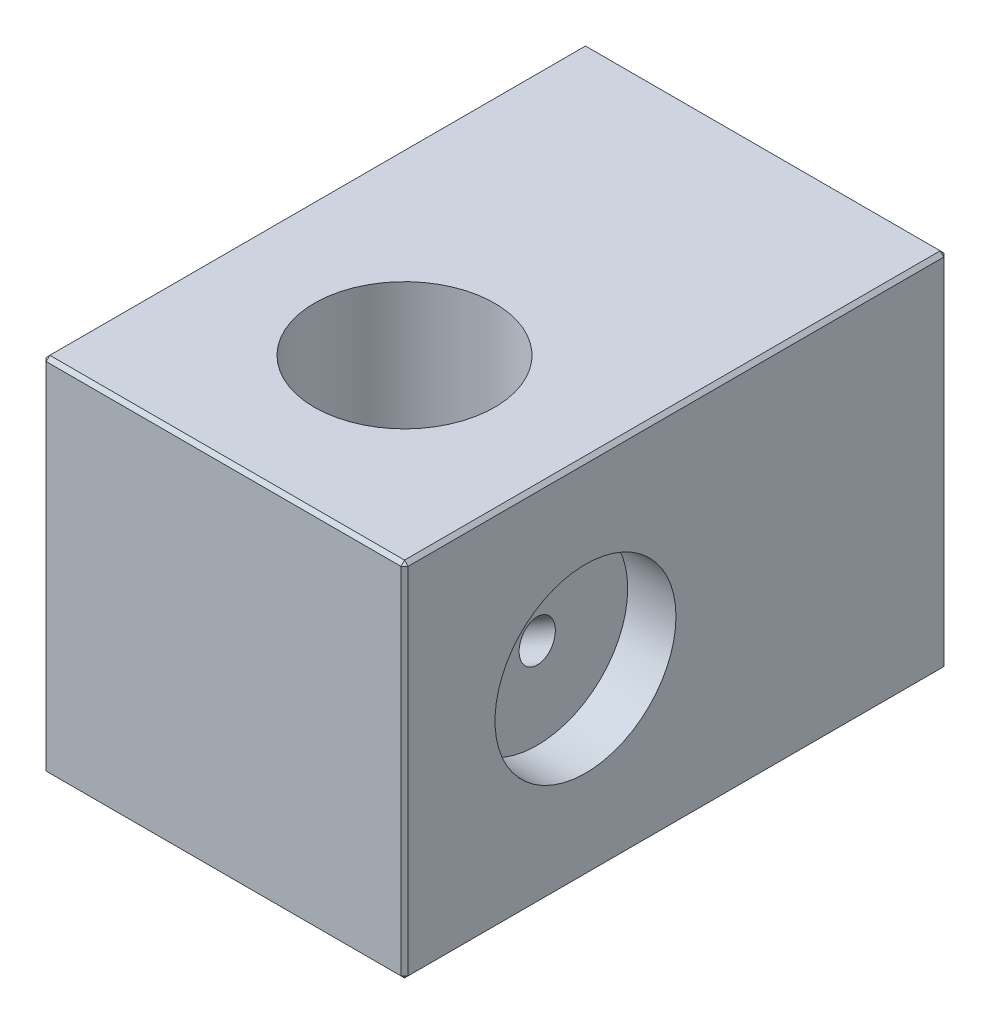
ISO-10303-21;
HEADER;
FILE_DESCRIPTION(('STEP AP214'),'2;1');
FILE_NAME('part.step','',(''),(''),'','','');
FILE_SCHEMA(('AUTOMOTIVE_DESIGN { 1 0 10303 214 1 1 1 1 }'));
ENDSEC;
DATA;
#1=APPLICATION_CONTEXT('core data for automotive mechanical design processes');
#2=APPLICATION_PROTOCOL_DEFINITION('international standard','automotive_design',2000,#1);
#3=PRODUCT_CONTEXT('',#1,'mechanical');
#4=PRODUCT('Part','Part','',(#3));
#5=PRODUCT_RELATED_PRODUCT_CATEGORY('part','',(#4));
#6=PRODUCT_DEFINITION_FORMATION('','',#4);
#7=PRODUCT_DEFINITION_CONTEXT('part definition',#1,'design');
#8=PRODUCT_DEFINITION('design','',#6,#7);
#9=PRODUCT_DEFINITION_SHAPE('','',#8);
#10=(LENGTH_UNIT() NAMED_UNIT(*) SI_UNIT(.MILLI.,.METRE.));
#11=(NAMED_UNIT(*) PLANE_ANGLE_UNIT() SI_UNIT($,.RADIAN.));
#12=(NAMED_UNIT(*) SI_UNIT($,.STERADIAN.) SOLID_ANGLE_UNIT());
#13=UNCERTAINTY_MEASURE_WITH_UNIT(LENGTH_MEASURE(1.E-05),#10,'distance_accuracy_value','');
#14=(GEOMETRIC_REPRESENTATION_CONTEXT(3) GLOBAL_UNCERTAINTY_ASSIGNED_CONTEXT((#13)) GLOBAL_UNIT_ASSIGNED_CONTEXT((#10,
#11,#12)) REPRESENTATION_CONTEXT('',''));
#15=CARTESIAN_POINT('',(0.,0.,0.));
#16=DIRECTION('',(0.,0.,1.));
#17=DIRECTION('',(1.,0.,0.));
#18=AXIS2_PLACEMENT_3D('',#15,#16,#17);
#19=CARTESIAN_POINT('',(-15.,30.,0.));
#20=DIRECTION('',(1.,0.,0.));
#21=DIRECTION('',(0.,0.,-1.));
#22=AXIS2_PLACEMENT_3D('',#19,#20,#21);
#23=PLANE('',#22);
#24=CARTESIAN_POINT('',(-15.,15.,-15.));
#25=DIRECTION('',(-1.,0.,0.));
#26=DIRECTION('',(0.,0.,1.));
#27=AXIS2_PLACEMENT_3D('',#24,#25,#26);
#28=CIRCLE('',#27,7.5);
#29=CARTESIAN_POINT('',(-15.,15.,-7.5));
#30=VERTEX_POINT('',#29);
#31=EDGE_CURVE('E188',#30,#30,#28,.T.);
#32=ORIENTED_EDGE('',*,*,#31,.F.);
#33=EDGE_LOOP('',(#32));
#34=FACE_BOUND('',#33,.T.);
#35=DIRECTION('',(0.,0.,1.));
#36=VECTOR('',#35,1.);
#37=CARTESIAN_POINT('',(-15.,0.300000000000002,0.));
#38=LINE('',#37,#36);
#39=CARTESIAN_POINT('',(-15.,0.300000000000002,-44.7));
#40=VERTEX_POINT('',#39);
#41=CARTESIAN_POINT('',(-15.,0.300000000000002,-0.300000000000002));
#42=VERTEX_POINT('',#41);
#43=EDGE_CURVE('E748',#40,#42,#38,.T.);
#44=ORIENTED_EDGE('',*,*,#43,.T.);
#45=DIRECTION('',(0.,1.,0.));
#46=VECTOR('',#45,1.);
#47=CARTESIAN_POINT('',(-15.,30.,-0.300000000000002));
#48=LINE('',#47,#46);
#49=CARTESIAN_POINT('',(-15.,29.7,-0.300000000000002));
#50=VERTEX_POINT('',#49);
#51=EDGE_CURVE('E750',#42,#50,#48,.T.);
#52=ORIENTED_EDGE('',*,*,#51,.T.);
#53=DIRECTION('',(0.,0.,-1.));
#54=VECTOR('',#53,1.);
#55=CARTESIAN_POINT('',(-15.,29.7,0.));
#56=LINE('',#55,#54);
#57=CARTESIAN_POINT('',(-15.,29.7,-44.7));
#58=VERTEX_POINT('',#57);
#59=EDGE_CURVE('E745',#50,#58,#56,.T.);
#60=ORIENTED_EDGE('',*,*,#59,.T.);
#61=DIRECTION('',(0.,-1.,0.));
#62=VECTOR('',#61,1.);
#63=CARTESIAN_POINT('',(-15.,30.,-44.7));
#64=LINE('',#63,#62);
#65=EDGE_CURVE('E343',#58,#40,#64,.T.);
#66=ORIENTED_EDGE('',*,*,#65,.T.);
#67=EDGE_LOOP('',(#44,#52,#60,#66));
#68=FACE_BOUND('',#67,.T.);
#69=ADVANCED_FACE('F37',(#34,#68),#23,.F.);
#70=CARTESIAN_POINT('',(-15.,30.,0.));
#71=DIRECTION('',(0.,0.,-1.));
#72=DIRECTION('',(-1.,0.,0.));
#73=AXIS2_PLACEMENT_3D('',#70,#71,#72);
#74=PLANE('',#73);
#75=DIRECTION('',(0.,-1.,0.));
#76=VECTOR('',#75,1.);
#77=CARTESIAN_POINT('',(-14.7,30.,0.));
#78=LINE('',#77,#76);
#79=CARTESIAN_POINT('',(-14.7,29.7,0.));
#80=VERTEX_POINT('',#79);
#81=CARTESIAN_POINT('',(-14.7,0.300000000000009,0.));
#82=VERTEX_POINT('',#81);
#83=EDGE_CURVE('E738',#80,#82,#78,.T.);
#84=ORIENTED_EDGE('',*,*,#83,.T.);
#85=DIRECTION('',(1.,0.,0.));
#86=VECTOR('',#85,1.);
#87=CARTESIAN_POINT('',(15.,0.300000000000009,0.));
#88=LINE('',#87,#86);
#89=CARTESIAN_POINT('',(14.7,0.300000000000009,0.));
#90=VERTEX_POINT('',#89);
#91=EDGE_CURVE('E743',#82,#90,#88,.T.);
#92=ORIENTED_EDGE('',*,*,#91,.T.);
#93=DIRECTION('',(0.,1.,0.));
#94=VECTOR('',#93,1.);
#95=CARTESIAN_POINT('',(14.7,30.,0.));
#96=LINE('',#95,#94);
#97=CARTESIAN_POINT('',(14.7,29.7,0.));
#98=VERTEX_POINT('',#97);
#99=EDGE_CURVE('E740',#90,#98,#96,.T.);
#100=ORIENTED_EDGE('',*,*,#99,.T.);
#101=DIRECTION('',(-1.,0.,0.));
#102=VECTOR('',#101,1.);
#103=CARTESIAN_POINT('',(-15.,29.7,0.));
#104=LINE('',#103,#102);
#105=EDGE_CURVE('E736',#98,#80,#104,.T.);
#106=ORIENTED_EDGE('',*,*,#105,.T.);
#107=EDGE_LOOP('',(#84,#92,#100,#106));
#108=FACE_BOUND('',#107,.T.);
#109=ADVANCED_FACE('F231',(#108),#74,.F.);
#110=CARTESIAN_POINT('',(15.,30.,0.));
#111=DIRECTION('',(-1.,0.,0.));
#112=DIRECTION('',(0.,0.,1.));
#113=AXIS2_PLACEMENT_3D('',#110,#111,#112);
#114=PLANE('',#113);
#115=CARTESIAN_POINT('',(15.,15.,-15.));
#116=DIRECTION('',(1.,0.,0.));
#117=DIRECTION('',(0.,0.,-1.));
#118=AXIS2_PLACEMENT_3D('',#115,#116,#117);
#119=CIRCLE('',#118,7.5);
#120=CARTESIAN_POINT('',(15.,15.,-22.5));
#121=VERTEX_POINT('',#120);
#122=EDGE_CURVE('E202',#121,#121,#119,.T.);
#123=ORIENTED_EDGE('',*,*,#122,.F.);
#124=EDGE_LOOP('',(#123));
#125=FACE_BOUND('',#124,.T.);
#126=DIRECTION('',(0.,0.,1.));
#127=VECTOR('',#126,1.);
#128=CARTESIAN_POINT('',(15.,29.7,0.));
#129=LINE('',#128,#127);
#130=CARTESIAN_POINT('',(15.,29.7,-44.7));
#131=VERTEX_POINT('',#130);
#132=CARTESIAN_POINT('',(15.,29.7,-0.300000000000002));
#133=VERTEX_POINT('',#132);
#134=EDGE_CURVE('E344',#131,#133,#129,.T.);
#135=ORIENTED_EDGE('',*,*,#134,.T.);
#136=DIRECTION('',(0.,-1.,0.));
#137=VECTOR('',#136,1.);
#138=CARTESIAN_POINT('',(15.,30.,-0.300000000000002));
#139=LINE('',#138,#137);
#140=CARTESIAN_POINT('',(15.,0.300000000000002,-0.300000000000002));
#141=VERTEX_POINT('',#140);
#142=EDGE_CURVE('E733',#133,#141,#139,.T.);
#143=ORIENTED_EDGE('',*,*,#142,.T.);
#144=DIRECTION('',(0.,0.,-1.));
#145=VECTOR('',#144,1.);
#146=CARTESIAN_POINT('',(15.,0.300000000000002,-45.));
#147=LINE('',#146,#145);
#148=CARTESIAN_POINT('',(15.,0.300000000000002,-44.7));
#149=VERTEX_POINT('',#148);
#150=EDGE_CURVE('E731',#141,#149,#147,.T.);
#151=ORIENTED_EDGE('',*,*,#150,.T.);
#152=DIRECTION('',(0.,1.,0.));
#153=VECTOR('',#152,1.);
#154=CARTESIAN_POINT('',(15.,30.,-44.7));
#155=LINE('',#154,#153);
#156=EDGE_CURVE('E729',#149,#131,#155,.T.);
#157=ORIENTED_EDGE('',*,*,#156,.T.);
#158=EDGE_LOOP('',(#135,#143,#151,#157));
#159=FACE_BOUND('',#158,.T.);
#160=ADVANCED_FACE('F237',(#125,#159),#114,.F.);
#161=CARTESIAN_POINT('',(-15.,30.,-45.));
#162=DIRECTION('',(0.,0.,1.));
#163=DIRECTION('',(1.,0.,0.));
#164=AXIS2_PLACEMENT_3D('',#161,#162,#163);
#165=PLANE('',#164);
#166=CARTESIAN_POINT('',(0.,15.,-45.));
#167=DIRECTION('',(0.,0.,-1.));
#168=DIRECTION('',(-1.,0.,0.));
#169=AXIS2_PLACEMENT_3D('',#166,#167,#168);
#170=CIRCLE('',#169,5.89999999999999);
#171=CARTESIAN_POINT('',(-5.89999999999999,15.,-45.));
#172=VERTEX_POINT('',#171);
#173=EDGE_CURVE('E682',#172,#172,#170,.T.);
#174=ORIENTED_EDGE('',*,*,#173,.F.);
#175=EDGE_LOOP('',(#174));
#176=FACE_BOUND('',#175,.T.);
#177=DIRECTION('',(-1.,0.,0.));
#178=VECTOR('',#177,1.);
#179=CARTESIAN_POINT('',(-15.,0.300000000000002,-45.));
#180=LINE('',#179,#178);
#181=CARTESIAN_POINT('',(14.7,0.300000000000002,-45.));
#182=VERTEX_POINT('',#181);
#183=CARTESIAN_POINT('',(-14.7,0.300000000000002,-45.));
#184=VERTEX_POINT('',#183);
#185=EDGE_CURVE('E352',#182,#184,#180,.T.);
#186=ORIENTED_EDGE('',*,*,#185,.T.);
#187=DIRECTION('',(0.,1.,0.));
#188=VECTOR('',#187,1.);
#189=CARTESIAN_POINT('',(-14.7,30.,-45.));
#190=LINE('',#189,#188);
#191=CARTESIAN_POINT('',(-14.7,29.7,-45.));
#192=VERTEX_POINT('',#191);
#193=EDGE_CURVE('E341',#184,#192,#190,.T.);
#194=ORIENTED_EDGE('',*,*,#193,.T.);
#195=DIRECTION('',(1.,0.,0.));
#196=VECTOR('',#195,1.);
#197=CARTESIAN_POINT('',(-15.,29.7,-45.));
#198=LINE('',#197,#196);
#199=CARTESIAN_POINT('',(14.7,29.7,-45.));
#200=VERTEX_POINT('',#199);
#201=EDGE_CURVE('E349',#192,#200,#198,.T.);
#202=ORIENTED_EDGE('',*,*,#201,.T.);
#203=DIRECTION('',(0.,-1.,0.));
#204=VECTOR('',#203,1.);
#205=CARTESIAN_POINT('',(14.7,30.,-45.));
#206=LINE('',#205,#204);
#207=EDGE_CURVE('E357',#200,#182,#206,.T.);
#208=ORIENTED_EDGE('',*,*,#207,.T.);
#209=EDGE_LOOP('',(#186,#194,#202,#208));
#210=FACE_BOUND('',#209,.T.);
#211=ADVANCED_FACE('F348',(#176,#210),#165,.F.);
#212=CARTESIAN_POINT('',(-15.,30.,-45.));
#213=DIRECTION('',(0.,-1.,0.));
#214=DIRECTION('',(0.,0.,-1.));
#215=AXIS2_PLACEMENT_3D('',#212,#213,#214);
#216=PLANE('',#215);
#217=CARTESIAN_POINT('',(0.,30.,-15.));
#218=DIRECTION('',(0.,1.,0.));
#219=DIRECTION('',(0.,0.,1.));
#220=AXIS2_PLACEMENT_3D('',#217,#218,#219);
#221=CIRCLE('',#220,7.475);
#222=CARTESIAN_POINT('',(0.,30.,-7.525));
#223=VERTEX_POINT('',#222);
#224=EDGE_CURVE('E715',#223,#223,#221,.T.);
#225=ORIENTED_EDGE('',*,*,#224,.F.);
#226=EDGE_LOOP('',(#225));
#227=FACE_BOUND('',#226,.T.);
#228=DIRECTION('',(0.,0.,-1.));
#229=VECTOR('',#228,1.);
#230=CARTESIAN_POINT('',(14.7,30.,-45.));
#231=LINE('',#230,#229);
#232=CARTESIAN_POINT('',(14.7,30.,-0.300000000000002));
#233=VERTEX_POINT('',#232);
#234=CARTESIAN_POINT('',(14.7,30.,-44.7));
#235=VERTEX_POINT('',#234);
#236=EDGE_CURVE('E355',#233,#235,#231,.T.);
#237=ORIENTED_EDGE('',*,*,#236,.T.);
#238=DIRECTION('',(-1.,0.,0.));
#239=VECTOR('',#238,1.);
#240=CARTESIAN_POINT('',(-15.,30.,-44.7));
#241=LINE('',#240,#239);
#242=CARTESIAN_POINT('',(-14.7,30.,-44.7));
#243=VERTEX_POINT('',#242);
#244=EDGE_CURVE('E364',#235,#243,#241,.T.);
#245=ORIENTED_EDGE('',*,*,#244,.T.);
#246=DIRECTION('',(0.,0.,1.));
#247=VECTOR('',#246,1.);
#248=CARTESIAN_POINT('',(-14.7,30.,-45.));
#249=LINE('',#248,#247);
#250=CARTESIAN_POINT('',(-14.7,30.,-0.300000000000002));
#251=VERTEX_POINT('',#250);
#252=EDGE_CURVE('E362',#243,#251,#249,.T.);
#253=ORIENTED_EDGE('',*,*,#252,.T.);
#254=DIRECTION('',(1.,0.,0.));
#255=VECTOR('',#254,1.);
#256=CARTESIAN_POINT('',(-15.,30.,-0.300000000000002));
#257=LINE('',#256,#255);
#258=EDGE_CURVE('E353',#251,#233,#257,.T.);
#259=ORIENTED_EDGE('',*,*,#258,.T.);
#260=EDGE_LOOP('',(#237,#245,#253,#259));
#261=FACE_BOUND('',#260,.T.);
#262=ADVANCED_FACE('F532',(#227,#261),#216,.F.);
#263=CARTESIAN_POINT('',(-15.,0.,-45.));
#264=DIRECTION('',(0.,-1.,0.));
#265=DIRECTION('',(0.,0.,-1.));
#266=AXIS2_PLACEMENT_3D('',#263,#264,#265);
#267=PLANE('',#266);
#268=DIRECTION('',(0.,0.,1.));
#269=VECTOR('',#268,1.);
#270=CARTESIAN_POINT('',(14.7,0.,0.));
#271=LINE('',#270,#269);
#272=CARTESIAN_POINT('',(14.7,0.,-44.7));
#273=VERTEX_POINT('',#272);
#274=CARTESIAN_POINT('',(14.7,0.,-0.300000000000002));
#275=VERTEX_POINT('',#274);
#276=EDGE_CURVE('E753',#273,#275,#271,.T.);
#277=ORIENTED_EDGE('',*,*,#276,.T.);
#278=DIRECTION('',(-1.,0.,0.));
#279=VECTOR('',#278,1.);
#280=CARTESIAN_POINT('',(-15.,0.,-0.300000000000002));
#281=LINE('',#280,#279);
#282=CARTESIAN_POINT('',(-14.7,0.,-0.300000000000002));
#283=VERTEX_POINT('',#282);
#284=EDGE_CURVE('E759',#275,#283,#281,.T.);
#285=ORIENTED_EDGE('',*,*,#284,.T.);
#286=DIRECTION('',(0.,0.,-1.));
#287=VECTOR('',#286,1.);
#288=CARTESIAN_POINT('',(-14.7,0.,-45.));
#289=LINE('',#288,#287);
#290=CARTESIAN_POINT('',(-14.7,0.,-44.7));
#291=VERTEX_POINT('',#290);
#292=EDGE_CURVE('E757',#283,#291,#289,.T.);
#293=ORIENTED_EDGE('',*,*,#292,.T.);
#294=DIRECTION('',(1.,0.,0.));
#295=VECTOR('',#294,1.);
#296=CARTESIAN_POINT('',(15.,0.,-44.7));
#297=LINE('',#296,#295);
#298=EDGE_CURVE('E755',#291,#273,#297,.T.);
#299=ORIENTED_EDGE('',*,*,#298,.T.);
#300=EDGE_LOOP('',(#277,#285,#293,#299));
#301=FACE_BOUND('',#300,.T.);
#302=ADVANCED_FACE('F322',(#301),#267,.T.);
#303=CARTESIAN_POINT('',(-15.,30.,-44.7));
#304=DIRECTION('',(0.707106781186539,0.,0.707106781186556));
#305=DIRECTION('',(0.707106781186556,0.,-0.707106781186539));
#306=AXIS2_PLACEMENT_3D('',#303,#304,#305);
#307=PLANE('',#306);
#308=DIRECTION('',(0.707106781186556,0.,-0.707106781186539));
#309=VECTOR('',#308,1.);
#310=CARTESIAN_POINT('',(-14.7,29.7,-45.));
#311=LINE('',#310,#309);
#312=EDGE_CURVE('E330',#192,#58,#311,.F.);
#313=ORIENTED_EDGE('',*,*,#312,.F.);
#314=ORIENTED_EDGE('',*,*,#193,.F.);
#315=DIRECTION('',(-0.707106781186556,0.,0.707106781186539));
#316=VECTOR('',#315,1.);
#317=CARTESIAN_POINT('',(-14.85,0.300000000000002,-44.85));
#318=LINE('',#317,#316);
#319=EDGE_CURVE('E345',#40,#184,#318,.F.);
#320=ORIENTED_EDGE('',*,*,#319,.F.);
#321=ORIENTED_EDGE('',*,*,#65,.F.);
#322=EDGE_LOOP('',(#313,#314,#320,#321));
#323=FACE_BOUND('',#322,.T.);
#324=ADVANCED_FACE('F39',(#323),#307,.F.);
#325=CARTESIAN_POINT('',(-14.7,29.7,-45.));
#326=DIRECTION('',(-0.577350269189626,0.577350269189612,-0.577350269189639));
#327=DIRECTION('',(-0.707106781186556,0.,0.707106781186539));
#328=AXIS2_PLACEMENT_3D('',#325,#326,#327);
#329=PLANE('',#328);
#330=DIRECTION('',(0.,0.707106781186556,0.707106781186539));
#331=VECTOR('',#330,1.);
#332=CARTESIAN_POINT('',(-14.7,29.7,-45.));
#333=LINE('',#332,#331);
#334=EDGE_CURVE('E328',#192,#243,#333,.T.);
#335=ORIENTED_EDGE('',*,*,#334,.F.);
#336=ORIENTED_EDGE('',*,*,#312,.T.);
#337=DIRECTION('',(-0.707106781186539,-0.707106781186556,0.));
#338=VECTOR('',#337,1.);
#339=CARTESIAN_POINT('',(-14.85,29.85,-44.7));
#340=LINE('',#339,#338);
#341=EDGE_CURVE('E332',#243,#58,#340,.T.);
#342=ORIENTED_EDGE('',*,*,#341,.F.);
#343=EDGE_LOOP('',(#335,#336,#342));
#344=FACE_BOUND('',#343,.T.);
#345=ADVANCED_FACE('F315',(#344),#329,.T.);
#346=CARTESIAN_POINT('',(-14.7,0.,-44.7));
#347=DIRECTION('',(-0.577350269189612,-0.577350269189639,-0.577350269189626));
#348=DIRECTION('',(0.,0.707106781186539,-0.707106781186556));
#349=AXIS2_PLACEMENT_3D('',#346,#347,#348);
#350=PLANE('',#349);
#351=DIRECTION('',(-0.707106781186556,0.707106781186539,0.));
#352=VECTOR('',#351,1.);
#353=CARTESIAN_POINT('',(-14.7,0.,-44.7));
#354=LINE('',#353,#352);
#355=EDGE_CURVE('E418',#40,#291,#354,.F.);
#356=ORIENTED_EDGE('',*,*,#355,.F.);
#357=ORIENTED_EDGE('',*,*,#319,.T.);
#358=DIRECTION('',(0.,-0.707106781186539,0.707106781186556));
#359=VECTOR('',#358,1.);
#360=CARTESIAN_POINT('',(-14.7,0.,-44.7));
#361=LINE('',#360,#359);
#362=EDGE_CURVE('E335',#291,#184,#361,.F.);
#363=ORIENTED_EDGE('',*,*,#362,.F.);
#364=EDGE_LOOP('',(#356,#357,#363));
#365=FACE_BOUND('',#364,.T.);
#366=ADVANCED_FACE('F312',(#365),#350,.T.);
#367=CARTESIAN_POINT('',(-14.7,30.,-45.));
#368=DIRECTION('',(0.707106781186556,-0.707106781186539,0.));
#369=DIRECTION('',(0.707106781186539,0.707106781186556,0.));
#370=AXIS2_PLACEMENT_3D('',#367,#368,#369);
#371=PLANE('',#370);
#372=ORIENTED_EDGE('',*,*,#341,.T.);
#373=ORIENTED_EDGE('',*,*,#59,.F.);
#374=DIRECTION('',(0.707106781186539,0.707106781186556,0.));
#375=VECTOR('',#374,1.);
#376=CARTESIAN_POINT('',(-15.,29.7,-0.300000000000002));
#377=LINE('',#376,#375);
#378=EDGE_CURVE('E413',#251,#50,#377,.F.);
#379=ORIENTED_EDGE('',*,*,#378,.F.);
#380=ORIENTED_EDGE('',*,*,#252,.F.);
#381=EDGE_LOOP('',(#372,#373,#379,#380));
#382=FACE_BOUND('',#381,.T.);
#383=ADVANCED_FACE('F308',(#382),#371,.F.);
#384=CARTESIAN_POINT('',(-15.,30.,-44.7));
#385=DIRECTION('',(0.,-0.707106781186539,0.707106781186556));
#386=DIRECTION('',(0.,-0.707106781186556,-0.707106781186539));
#387=AXIS2_PLACEMENT_3D('',#384,#385,#386);
#388=PLANE('',#387);
#389=ORIENTED_EDGE('',*,*,#334,.T.);
#390=ORIENTED_EDGE('',*,*,#244,.F.);
#391=DIRECTION('',(0.,-0.707106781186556,-0.707106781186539));
#392=VECTOR('',#391,1.);
#393=CARTESIAN_POINT('',(14.7,29.85,-44.85));
#394=LINE('',#393,#392);
#395=EDGE_CURVE('E410',#200,#235,#394,.F.);
#396=ORIENTED_EDGE('',*,*,#395,.F.);
#397=ORIENTED_EDGE('',*,*,#201,.F.);
#398=EDGE_LOOP('',(#389,#390,#396,#397));
#399=FACE_BOUND('',#398,.T.);
#400=ADVANCED_FACE('F304',(#399),#388,.F.);
#401=CARTESIAN_POINT('',(14.7,30.,-45.));
#402=DIRECTION('',(-0.707106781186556,0.,0.707106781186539));
#403=DIRECTION('',(0.707106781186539,0.,0.707106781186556));
#404=AXIS2_PLACEMENT_3D('',#401,#402,#403);
#405=PLANE('',#404);
#406=DIRECTION('',(-0.707106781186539,0.,-0.707106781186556));
#407=VECTOR('',#406,1.);
#408=CARTESIAN_POINT('',(14.85,0.300000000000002,-44.85));
#409=LINE('',#408,#407);
#410=EDGE_CURVE('E404',#182,#149,#409,.F.);
#411=ORIENTED_EDGE('',*,*,#410,.F.);
#412=ORIENTED_EDGE('',*,*,#207,.F.);
#413=DIRECTION('',(0.707106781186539,0.,0.707106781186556));
#414=VECTOR('',#413,1.);
#415=CARTESIAN_POINT('',(15.,29.7,-44.7));
#416=LINE('',#415,#414);
#417=EDGE_CURVE('E407',#131,#200,#416,.F.);
#418=ORIENTED_EDGE('',*,*,#417,.F.);
#419=ORIENTED_EDGE('',*,*,#156,.F.);
#420=EDGE_LOOP('',(#411,#412,#418,#419));
#421=FACE_BOUND('',#420,.T.);
#422=ADVANCED_FACE('F300',(#421),#405,.F.);
#423=CARTESIAN_POINT('',(-15.,0.300000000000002,-45.));
#424=DIRECTION('',(0.,-0.707106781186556,-0.707106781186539));
#425=DIRECTION('',(0.,0.707106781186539,-0.707106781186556));
#426=AXIS2_PLACEMENT_3D('',#423,#424,#425);
#427=PLANE('',#426);
#428=ORIENTED_EDGE('',*,*,#362,.T.);
#429=ORIENTED_EDGE('',*,*,#185,.F.);
#430=DIRECTION('',(0.,0.707106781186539,-0.707106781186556));
#431=VECTOR('',#430,1.);
#432=CARTESIAN_POINT('',(14.7,0.,-44.7));
#433=LINE('',#432,#431);
#434=EDGE_CURVE('E401',#273,#182,#433,.T.);
#435=ORIENTED_EDGE('',*,*,#434,.F.);
#436=ORIENTED_EDGE('',*,*,#298,.F.);
#437=EDGE_LOOP('',(#428,#429,#435,#436));
#438=FACE_BOUND('',#437,.T.);
#439=ADVANCED_FACE('F296',(#438),#427,.T.);
#440=CARTESIAN_POINT('',(-15.,0.300000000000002,0.));
#441=DIRECTION('',(-0.707106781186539,-0.707106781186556,0.));
#442=DIRECTION('',(0.707106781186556,-0.707106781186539,0.));
#443=AXIS2_PLACEMENT_3D('',#440,#441,#442);
#444=PLANE('',#443);
#445=ORIENTED_EDGE('',*,*,#355,.T.);
#446=ORIENTED_EDGE('',*,*,#292,.F.);
#447=DIRECTION('',(0.707106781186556,-0.707106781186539,0.));
#448=VECTOR('',#447,1.);
#449=CARTESIAN_POINT('',(-14.85,0.150000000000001,-0.300000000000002));
#450=LINE('',#449,#448);
#451=EDGE_CURVE('E398',#42,#283,#450,.T.);
#452=ORIENTED_EDGE('',*,*,#451,.F.);
#453=ORIENTED_EDGE('',*,*,#43,.F.);
#454=EDGE_LOOP('',(#445,#446,#452,#453));
#455=FACE_BOUND('',#454,.T.);
#456=ADVANCED_FACE('F292',(#455),#444,.T.);
#457=CARTESIAN_POINT('',(-14.7,30.,0.));
#458=DIRECTION('',(0.707106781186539,0.,-0.707106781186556));
#459=DIRECTION('',(-0.707106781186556,0.,-0.707106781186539));
#460=AXIS2_PLACEMENT_3D('',#457,#458,#459);
#461=PLANE('',#460);
#462=DIRECTION('',(-0.707106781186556,0.,-0.707106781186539));
#463=VECTOR('',#462,1.);
#464=CARTESIAN_POINT('',(-15.,29.7,-0.300000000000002));
#465=LINE('',#464,#463);
#466=EDGE_CURVE('E415',#50,#80,#465,.F.);
#467=ORIENTED_EDGE('',*,*,#466,.F.);
#468=ORIENTED_EDGE('',*,*,#51,.F.);
#469=DIRECTION('',(0.707106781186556,0.,0.707106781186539));
#470=VECTOR('',#469,1.);
#471=CARTESIAN_POINT('',(-14.7,0.300000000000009,0.));
#472=LINE('',#471,#470);
#473=EDGE_CURVE('E395',#82,#42,#472,.F.);
#474=ORIENTED_EDGE('',*,*,#473,.F.);
#475=ORIENTED_EDGE('',*,*,#83,.F.);
#476=EDGE_LOOP('',(#467,#468,#474,#475));
#477=FACE_BOUND('',#476,.T.);
#478=ADVANCED_FACE('F288',(#477),#461,.F.);
#479=CARTESIAN_POINT('',(-15.,29.7,-0.300000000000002));
#480=DIRECTION('',(-0.577350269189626,0.577350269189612,0.577350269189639));
#481=DIRECTION('',(0.707106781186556,0.,0.707106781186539));
#482=AXIS2_PLACEMENT_3D('',#479,#480,#481);
#483=PLANE('',#482);
#484=ORIENTED_EDGE('',*,*,#378,.T.);
#485=ORIENTED_EDGE('',*,*,#466,.T.);
#486=DIRECTION('',(0.,-0.707106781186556,0.707106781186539));
#487=VECTOR('',#486,1.);
#488=CARTESIAN_POINT('',(-14.7,29.85,-0.150000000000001));
#489=LINE('',#488,#487);
#490=EDGE_CURVE('E392',#251,#80,#489,.T.);
#491=ORIENTED_EDGE('',*,*,#490,.F.);
#492=EDGE_LOOP('',(#484,#485,#491));
#493=FACE_BOUND('',#492,.T.);
#494=ADVANCED_FACE('F284',(#493),#483,.T.);
#495=CARTESIAN_POINT('',(15.,29.7,-44.7));
#496=DIRECTION('',(0.577350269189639,0.577350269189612,-0.577350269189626));
#497=DIRECTION('',(-0.707106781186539,0.,-0.707106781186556));
#498=AXIS2_PLACEMENT_3D('',#495,#496,#497);
#499=PLANE('',#498);
#500=ORIENTED_EDGE('',*,*,#417,.T.);
#501=ORIENTED_EDGE('',*,*,#395,.T.);
#502=DIRECTION('',(-0.707106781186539,0.707106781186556,0.));
#503=VECTOR('',#502,1.);
#504=CARTESIAN_POINT('',(15.,29.7,-44.7));
#505=LINE('',#504,#503);
#506=EDGE_CURVE('E389',#131,#235,#505,.T.);
#507=ORIENTED_EDGE('',*,*,#506,.F.);
#508=EDGE_LOOP('',(#500,#501,#507));
#509=FACE_BOUND('',#508,.T.);
#510=ADVANCED_FACE('F280',(#509),#499,.T.);
#511=CARTESIAN_POINT('',(14.7,0.,-44.7));
#512=DIRECTION('',(0.577350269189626,-0.577350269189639,-0.577350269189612));
#513=DIRECTION('',(0.707106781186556,0.707106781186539,0.));
#514=AXIS2_PLACEMENT_3D('',#511,#512,#513);
#515=PLANE('',#514);
#516=ORIENTED_EDGE('',*,*,#434,.T.);
#517=ORIENTED_EDGE('',*,*,#410,.T.);
#518=DIRECTION('',(-0.707106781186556,-0.707106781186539,0.));
#519=VECTOR('',#518,1.);
#520=CARTESIAN_POINT('',(14.7,0.,-44.7));
#521=LINE('',#520,#519);
#522=EDGE_CURVE('E386',#273,#149,#521,.F.);
#523=ORIENTED_EDGE('',*,*,#522,.F.);
#524=EDGE_LOOP('',(#516,#517,#523));
#525=FACE_BOUND('',#524,.T.);
#526=ADVANCED_FACE('F276',(#525),#515,.T.);
#527=CARTESIAN_POINT('',(-14.7,0.300000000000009,0.));
#528=DIRECTION('',(-0.577350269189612,-0.577350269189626,0.577350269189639));
#529=DIRECTION('',(0.,-0.707106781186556,-0.707106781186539));
#530=AXIS2_PLACEMENT_3D('',#527,#528,#529);
#531=PLANE('',#530);
#532=ORIENTED_EDGE('',*,*,#473,.T.);
#533=ORIENTED_EDGE('',*,*,#451,.T.);
#534=DIRECTION('',(0.,0.707106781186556,0.707106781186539));
#535=VECTOR('',#534,1.);
#536=CARTESIAN_POINT('',(-14.7,0.300000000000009,0.));
#537=LINE('',#536,#535);
#538=EDGE_CURVE('E384',#82,#283,#537,.F.);
#539=ORIENTED_EDGE('',*,*,#538,.F.);
#540=EDGE_LOOP('',(#532,#533,#539));
#541=FACE_BOUND('',#540,.T.);
#542=ADVANCED_FACE('F272',(#541),#531,.T.);
#543=CARTESIAN_POINT('',(-15.,30.,-0.300000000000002));
#544=DIRECTION('',(0.,-0.707106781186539,-0.707106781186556));
#545=DIRECTION('',(0.,0.707106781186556,-0.707106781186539));
#546=AXIS2_PLACEMENT_3D('',#543,#544,#545);
#547=PLANE('',#546);
#548=ORIENTED_EDGE('',*,*,#490,.T.);
#549=ORIENTED_EDGE('',*,*,#105,.F.);
#550=DIRECTION('',(0.,0.707106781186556,-0.707106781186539));
#551=VECTOR('',#550,1.);
#552=CARTESIAN_POINT('',(14.7,29.7,0.));
#553=LINE('',#552,#551);
#554=EDGE_CURVE('E381',#233,#98,#553,.F.);
#555=ORIENTED_EDGE('',*,*,#554,.F.);
#556=ORIENTED_EDGE('',*,*,#258,.F.);
#557=EDGE_LOOP('',(#548,#549,#555,#556));
#558=FACE_BOUND('',#557,.T.);
#559=ADVANCED_FACE('F268',(#558),#547,.F.);
#560=CARTESIAN_POINT('',(14.7,30.,-45.));
#561=DIRECTION('',(-0.707106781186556,-0.707106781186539,0.));
#562=DIRECTION('',(0.707106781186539,-0.707106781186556,0.));
#563=AXIS2_PLACEMENT_3D('',#560,#561,#562);
#564=PLANE('',#563);
#565=ORIENTED_EDGE('',*,*,#506,.T.);
#566=ORIENTED_EDGE('',*,*,#236,.F.);
#567=DIRECTION('',(0.707106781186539,-0.707106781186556,0.));
#568=VECTOR('',#567,1.);
#569=CARTESIAN_POINT('',(14.85,29.85,-0.300000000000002));
#570=LINE('',#569,#568);
#571=EDGE_CURVE('E378',#133,#233,#570,.F.);
#572=ORIENTED_EDGE('',*,*,#571,.F.);
#573=ORIENTED_EDGE('',*,*,#134,.F.);
#574=EDGE_LOOP('',(#565,#566,#572,#573));
#575=FACE_BOUND('',#574,.T.);
#576=ADVANCED_FACE('F264',(#575),#564,.F.);
#577=CARTESIAN_POINT('',(15.,0.300000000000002,0.));
#578=DIRECTION('',(0.707106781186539,-0.707106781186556,0.));
#579=DIRECTION('',(0.707106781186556,0.707106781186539,0.));
#580=AXIS2_PLACEMENT_3D('',#577,#578,#579);
#581=PLANE('',#580);
#582=ORIENTED_EDGE('',*,*,#522,.T.);
#583=ORIENTED_EDGE('',*,*,#150,.F.);
#584=DIRECTION('',(0.707106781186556,0.707106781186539,0.));
#585=VECTOR('',#584,1.);
#586=CARTESIAN_POINT('',(15.,0.300000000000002,-0.300000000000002));
#587=LINE('',#586,#585);
#588=EDGE_CURVE('E375',#275,#141,#587,.T.);
#589=ORIENTED_EDGE('',*,*,#588,.F.);
#590=ORIENTED_EDGE('',*,*,#276,.F.);
#591=EDGE_LOOP('',(#582,#583,#589,#590));
#592=FACE_BOUND('',#591,.T.);
#593=ADVANCED_FACE('F260',(#592),#581,.T.);
#594=CARTESIAN_POINT('',(-15.,0.300000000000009,0.));
#595=DIRECTION('',(0.,-0.707106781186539,0.707106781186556));
#596=DIRECTION('',(0.,-0.707106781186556,-0.707106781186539));
#597=AXIS2_PLACEMENT_3D('',#594,#595,#596);
#598=PLANE('',#597);
#599=ORIENTED_EDGE('',*,*,#538,.T.);
#600=ORIENTED_EDGE('',*,*,#284,.F.);
#601=DIRECTION('',(0.,-0.707106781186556,-0.707106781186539));
#602=VECTOR('',#601,1.);
#603=CARTESIAN_POINT('',(14.7,0.150000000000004,-0.150000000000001));
#604=LINE('',#603,#602);
#605=EDGE_CURVE('E372',#90,#275,#604,.T.);
#606=ORIENTED_EDGE('',*,*,#605,.F.);
#607=ORIENTED_EDGE('',*,*,#91,.F.);
#608=EDGE_LOOP('',(#599,#600,#606,#607));
#609=FACE_BOUND('',#608,.T.);
#610=ADVANCED_FACE('F256',(#609),#598,.T.);
#611=CARTESIAN_POINT('',(14.7,29.7,0.));
#612=DIRECTION('',(0.577350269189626,0.577350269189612,0.577350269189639));
#613=DIRECTION('',(0.707106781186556,0.,-0.707106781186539));
#614=AXIS2_PLACEMENT_3D('',#611,#612,#613);
#615=PLANE('',#614);
#616=ORIENTED_EDGE('',*,*,#571,.T.);
#617=ORIENTED_EDGE('',*,*,#554,.T.);
#618=DIRECTION('',(-0.707106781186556,0.,0.707106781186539));
#619=VECTOR('',#618,1.);
#620=CARTESIAN_POINT('',(14.7,29.7,0.));
#621=LINE('',#620,#619);
#622=EDGE_CURVE('E369',#133,#98,#621,.T.);
#623=ORIENTED_EDGE('',*,*,#622,.F.);
#624=EDGE_LOOP('',(#616,#617,#623));
#625=FACE_BOUND('',#624,.T.);
#626=ADVANCED_FACE('F252',(#625),#615,.T.);
#627=CARTESIAN_POINT('',(15.,0.300000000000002,-0.300000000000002));
#628=DIRECTION('',(0.577350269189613,-0.577350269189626,0.577350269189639));
#629=DIRECTION('',(0.,-0.707106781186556,-0.707106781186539));
#630=AXIS2_PLACEMENT_3D('',#627,#628,#629);
#631=PLANE('',#630);
#632=ORIENTED_EDGE('',*,*,#605,.T.);
#633=ORIENTED_EDGE('',*,*,#588,.T.);
#634=DIRECTION('',(0.707106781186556,0.,-0.707106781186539));
#635=VECTOR('',#634,1.);
#636=CARTESIAN_POINT('',(15.,0.300000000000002,-0.300000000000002));
#637=LINE('',#636,#635);
#638=EDGE_CURVE('E367',#90,#141,#637,.T.);
#639=ORIENTED_EDGE('',*,*,#638,.F.);
#640=EDGE_LOOP('',(#632,#633,#639));
#641=FACE_BOUND('',#640,.T.);
#642=ADVANCED_FACE('F248',(#641),#631,.T.);
#643=CARTESIAN_POINT('',(15.,30.,-0.300000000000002));
#644=DIRECTION('',(-0.707106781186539,0.,-0.707106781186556));
#645=DIRECTION('',(-0.707106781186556,0.,0.707106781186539));
#646=AXIS2_PLACEMENT_3D('',#643,#644,#645);
#647=PLANE('',#646);
#648=ORIENTED_EDGE('',*,*,#622,.T.);
#649=ORIENTED_EDGE('',*,*,#99,.F.);
#650=ORIENTED_EDGE('',*,*,#638,.T.);
#651=ORIENTED_EDGE('',*,*,#142,.F.);
#652=EDGE_LOOP('',(#648,#649,#650,#651));
#653=FACE_BOUND('',#652,.T.);
#654=ADVANCED_FACE('F244',(#653),#647,.F.);
#655=CARTESIAN_POINT('',(0.,18.,-15.));
#656=DIRECTION('',(0.,1.,0.));
#657=DIRECTION('',(0.,0.,1.));
#658=AXIS2_PLACEMENT_3D('',#655,#656,#657);
#659=CYLINDRICAL_SURFACE('',#658,7.475);
#660=CARTESIAN_POINT('',(0.,18.,-15.));
#661=DIRECTION('',(0.,1.,0.));
#662=DIRECTION('',(0.,0.,1.));
#663=AXIS2_PLACEMENT_3D('',#660,#661,#662);
#664=CIRCLE('',#663,7.475);
#665=CARTESIAN_POINT('',(0.,18.,-7.525));
#666=VERTEX_POINT('',#665);
#667=EDGE_CURVE('E370',#666,#666,#664,.T.);
#668=ORIENTED_EDGE('',*,*,#667,.F.);
#669=EDGE_LOOP('',(#668));
#670=FACE_BOUND('',#669,.T.);
#671=ORIENTED_EDGE('',*,*,#224,.T.);
#672=EDGE_LOOP('',(#671));
#673=FACE_BOUND('',#672,.T.);
#674=ADVANCED_FACE('F247',(#670,#673),#659,.F.);
#675=CARTESIAN_POINT('',(0.,18.,-15.));
#676=DIRECTION('',(0.,1.,0.));
#677=DIRECTION('',(0.,0.,1.));
#678=AXIS2_PLACEMENT_3D('',#675,#676,#677);
#679=PLANE('',#678);
#680=CARTESIAN_POINT('',(0.,18.,-15.));
#681=DIRECTION('',(0.,1.,0.));
#682=DIRECTION('',(0.,0.,1.));
#683=AXIS2_PLACEMENT_3D('',#680,#681,#682);
#684=CIRCLE('',#683,6.25);
#685=CARTESIAN_POINT('',(0.,18.,-8.75));
#686=VERTEX_POINT('',#685);
#687=EDGE_CURVE('E719',#686,#686,#684,.T.);
#688=ORIENTED_EDGE('',*,*,#687,.F.);
#689=EDGE_LOOP('',(#688));
#690=FACE_BOUND('',#689,.T.);
#691=ORIENTED_EDGE('',*,*,#667,.T.);
#692=EDGE_LOOP('',(#691));
#693=FACE_BOUND('',#692,.T.);
#694=ADVANCED_FACE('F508',(#690,#693),#679,.T.);
#695=CARTESIAN_POINT('',(0.,15.,-15.));
#696=DIRECTION('',(0.,1.,0.));
#697=DIRECTION('',(0.,0.,1.));
#698=AXIS2_PLACEMENT_3D('',#695,#696,#697);
#699=CYLINDRICAL_SURFACE('',#698,6.25);
#700=CARTESIAN_POINT('',(0.,15.,-15.));
#701=DIRECTION('',(0.,1.,0.));
#702=DIRECTION('',(0.,0.,1.));
#703=AXIS2_PLACEMENT_3D('',#700,#701,#702);
#704=CIRCLE('',#703,6.25);
#705=CARTESIAN_POINT('',(-1.49999999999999,15.,-21.0673305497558));
#706=VERTEX_POINT('',#705);
#707=CARTESIAN_POINT('',(-6.0673305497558,15.,-16.5));
#708=VERTEX_POINT('',#707);
#709=EDGE_CURVE('E61',#706,#708,#704,.T.);
#710=ORIENTED_EDGE('',*,*,#709,.F.);
#711=CARTESIAN_POINT('',(-1.49999999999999,15.,-21.0673305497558));
#712=CARTESIAN_POINT('',(-1.50000044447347,15.0415503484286,-21.0673278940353));
#713=CARTESIAN_POINT('',(-1.49827246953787,15.0830801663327,-21.0677579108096));
#714=CARTESIAN_POINT('',(-1.49138362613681,15.1658303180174,-21.0694557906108));
#715=CARTESIAN_POINT('',(-1.48622330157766,15.2070506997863,-21.0707235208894));
#716=CARTESIAN_POINT('',(-1.46566679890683,15.3296388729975,-21.0757330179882));
#717=CARTESIAN_POINT('',(-1.44519478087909,15.4101660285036,-21.0806813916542));
#718=CARTESIAN_POINT('',(-1.39137014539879,15.566511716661,-21.0932209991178));
#719=CARTESIAN_POINT('',(-1.35801816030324,15.642330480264,-21.1008121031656));
#720=CARTESIAN_POINT('',(-1.27941749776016,15.7873314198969,-21.1177775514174));
#721=CARTESIAN_POINT('',(-1.23416605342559,15.8565120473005,-21.1271523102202));
#722=CARTESIAN_POINT('',(-1.13208222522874,15.9876331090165,-21.1468392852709));
#723=CARTESIAN_POINT('',(-1.07505470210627,16.0494194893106,-21.1571654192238));
#724=CARTESIAN_POINT('',(-0.951452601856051,16.1626537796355,-21.1774715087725));
#725=CARTESIAN_POINT('',(-0.884876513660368,16.2141000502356,-21.1874514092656));
#726=CARTESIAN_POINT('',(-0.743015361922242,16.3058144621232,-21.2060940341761));
#727=CARTESIAN_POINT('',(-0.667629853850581,16.3459313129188,-21.2147382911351));
#728=CARTESIAN_POINT('',(-0.510947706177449,16.4128646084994,-21.2295758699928));
#729=CARTESIAN_POINT('',(-0.429652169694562,16.4396835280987,-21.2357696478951));
#730=CARTESIAN_POINT('',(-0.265069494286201,16.4787688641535,-21.2449099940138));
#731=CARTESIAN_POINT('',(-0.181848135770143,16.4912983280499,-21.2479151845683));
#732=CARTESIAN_POINT('',(-0.0144321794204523,16.5022737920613,-21.2505436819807));
#733=CARTESIAN_POINT('',(0.0697623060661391,16.5007214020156,-21.2501673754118));
#734=CARTESIAN_POINT('',(0.234909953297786,16.4837681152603,-21.2461191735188));
#735=CARTESIAN_POINT('',(0.315894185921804,16.4686513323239,-21.2425148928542));
#736=CARTESIAN_POINT('',(0.474140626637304,16.4254538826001,-21.2324939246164));
#737=CARTESIAN_POINT('',(0.551402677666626,16.3973726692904,-21.2260771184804));
#738=CARTESIAN_POINT('',(0.700775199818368,16.328806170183,-21.2110467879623));
#739=CARTESIAN_POINT('',(0.772836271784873,16.2882174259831,-21.2024150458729));
#740=CARTESIAN_POINT('',(0.909223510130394,16.1958668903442,-21.1838949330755));
#741=CARTESIAN_POINT('',(0.973548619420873,16.1441035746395,-21.1740063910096));
#742=CARTESIAN_POINT('',(1.09432622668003,16.0293493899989,-21.1537629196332));
#743=CARTESIAN_POINT('',(1.15054308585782,15.9661112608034,-21.1434025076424));
#744=CARTESIAN_POINT('',(1.25163731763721,15.8309778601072,-21.1236072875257));
#745=CARTESIAN_POINT('',(1.29651159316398,15.7590802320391,-21.1141727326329));
#746=CARTESIAN_POINT('',(1.37378496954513,15.6082223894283,-21.0972774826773));
#747=CARTESIAN_POINT('',(1.40612437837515,15.5292305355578,-21.0898262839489));
#748=CARTESIAN_POINT('',(1.45695171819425,15.3667579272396,-21.0778684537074));
#749=CARTESIAN_POINT('',(1.47546031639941,15.2832840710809,-21.0733574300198));
#750=CARTESIAN_POINT('',(1.49116912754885,15.1659157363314,-21.0695080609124));
#751=CARTESIAN_POINT('',(1.49448141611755,15.1327965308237,-21.0686926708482));
#752=CARTESIAN_POINT('',(1.49889429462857,15.0664567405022,-21.0676042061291));
#753=CARTESIAN_POINT('',(1.49999850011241,15.0332364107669,-21.0673302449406));
#754=CARTESIAN_POINT('',(1.49999999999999,15.,-21.0673305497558));
#755=B_SPLINE_CURVE_WITH_KNOTS('',3,(#711,#712,#713,#714,#715,#716,#717,#718,#719,#720,#721,
#722,#723,#724,#725,#726,#727,#728,#729,#730,#731,#732,#733,#734,#735,#736,#737,#738,#739,#740,
#741,#742,#743,#744,#745,#746,#747,#748,#749,#750,#751,#752,#753,#754),.UNSPECIFIED.,.F.,.F.,(4,
2,2,2,2,2,2,2,2,2,2,2,2,2,2,2,2,2,2,2,2,4),(0.,0.124572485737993,0.249125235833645,
0.497542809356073,0.745948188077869,0.994411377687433,1.24738047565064,1.50038965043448,
1.75663291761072,2.01282847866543,2.26422762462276,2.51559803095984,2.76182316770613,
3.00805868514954,3.25638829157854,3.5047517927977,3.75929345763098,4.01390454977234,
4.26971364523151,4.52513971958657,4.62496108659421,4.72461887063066),.UNSPECIFIED.);
#756=CARTESIAN_POINT('',(1.49999999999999,15.,-21.0673305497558));
#757=VERTEX_POINT('',#756);
#758=EDGE_CURVE('E165',#706,#757,#755,.T.);
#759=ORIENTED_EDGE('',*,*,#758,.T.);
#760=CARTESIAN_POINT('',(-6.0673305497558,15.,-13.5));
#761=VERTEX_POINT('',#760);
#762=EDGE_CURVE('E172',#761,#757,#704,.T.);
#763=ORIENTED_EDGE('',*,*,#762,.F.);
#764=CARTESIAN_POINT('',(-6.0673305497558,15.,-13.5));
#765=CARTESIAN_POINT('',(-6.06732789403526,15.0415503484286,-13.4999995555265));
#766=CARTESIAN_POINT('',(-6.06775791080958,15.0830801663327,-13.5017275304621));
#767=CARTESIAN_POINT('',(-6.06945579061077,15.1658303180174,-13.5086163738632));
#768=CARTESIAN_POINT('',(-6.07072352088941,15.2070506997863,-13.5137766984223));
#769=CARTESIAN_POINT('',(-6.07573301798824,15.3296388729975,-13.5343332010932));
#770=CARTESIAN_POINT('',(-6.08068139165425,15.4101660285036,-13.5548052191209));
#771=CARTESIAN_POINT('',(-6.09322099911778,15.566511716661,-13.6086298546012));
#772=CARTESIAN_POINT('',(-6.10081210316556,15.642330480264,-13.6419818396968));
#773=CARTESIAN_POINT('',(-6.11777755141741,15.7873314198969,-13.7205825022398));
#774=CARTESIAN_POINT('',(-6.12715231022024,15.8565120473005,-13.7658339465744));
#775=CARTESIAN_POINT('',(-6.1468392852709,15.9876331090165,-13.8679177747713));
#776=CARTESIAN_POINT('',(-6.15716541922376,16.0494194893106,-13.9249452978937));
#777=CARTESIAN_POINT('',(-6.17747150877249,16.1626537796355,-14.0485473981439));
#778=CARTESIAN_POINT('',(-6.18745140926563,16.2141000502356,-14.1151234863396));
#779=CARTESIAN_POINT('',(-6.20609403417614,16.3058144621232,-14.2569846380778));
#780=CARTESIAN_POINT('',(-6.21473829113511,16.3459313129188,-14.3323701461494));
#781=CARTESIAN_POINT('',(-6.22957586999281,16.4128646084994,-14.4890522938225));
#782=CARTESIAN_POINT('',(-6.23576964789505,16.4396835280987,-14.5703478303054));
#783=CARTESIAN_POINT('',(-6.24490999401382,16.4787688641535,-14.7349305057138));
#784=CARTESIAN_POINT('',(-6.24791518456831,16.4912983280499,-14.8181518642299));
#785=CARTESIAN_POINT('',(-6.2505436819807,16.5022737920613,-14.9855678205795));
#786=CARTESIAN_POINT('',(-6.25016737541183,16.5007214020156,-15.0697623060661));
#787=CARTESIAN_POINT('',(-6.24611917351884,16.4837681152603,-15.2349099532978));
#788=CARTESIAN_POINT('',(-6.24251489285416,16.4686513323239,-15.3158941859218));
#789=CARTESIAN_POINT('',(-6.23249392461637,16.4254538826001,-15.4741406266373));
#790=CARTESIAN_POINT('',(-6.22607711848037,16.3973726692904,-15.5514026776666));
#791=CARTESIAN_POINT('',(-6.21104678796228,16.328806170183,-15.7007751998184));
#792=CARTESIAN_POINT('',(-6.20241504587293,16.2882174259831,-15.7728362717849));
#793=CARTESIAN_POINT('',(-6.18389493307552,16.1958668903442,-15.9092235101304));
#794=CARTESIAN_POINT('',(-6.17400639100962,16.1441035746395,-15.9735486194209));
#795=CARTESIAN_POINT('',(-6.1537629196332,16.0293493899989,-16.09432622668));
#796=CARTESIAN_POINT('',(-6.14340250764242,15.9661112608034,-16.1505430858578));
#797=CARTESIAN_POINT('',(-6.12360728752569,15.8309778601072,-16.2516373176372));
#798=CARTESIAN_POINT('',(-6.11417273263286,15.7590802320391,-16.296511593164));
#799=CARTESIAN_POINT('',(-6.09727748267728,15.6082223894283,-16.3737849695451));
#800=CARTESIAN_POINT('',(-6.08982628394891,15.5292305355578,-16.4061243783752));
#801=CARTESIAN_POINT('',(-6.0778684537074,15.3667579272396,-16.4569517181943));
#802=CARTESIAN_POINT('',(-6.07335743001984,15.2832840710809,-16.4754603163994));
#803=CARTESIAN_POINT('',(-6.06950806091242,15.1659157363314,-16.4911691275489));
#804=CARTESIAN_POINT('',(-6.06869267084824,15.1327965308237,-16.4944814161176));
#805=CARTESIAN_POINT('',(-6.06760420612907,15.0664567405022,-16.4988942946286));
#806=CARTESIAN_POINT('',(-6.06733024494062,15.0332364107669,-16.4999985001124));
#807=CARTESIAN_POINT('',(-6.0673305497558,15.,-16.5));
#808=B_SPLINE_CURVE_WITH_KNOTS('',3,(#764,#765,#766,#767,#768,#769,#770,#771,#772,#773,#774,
#775,#776,#777,#778,#779,#780,#781,#782,#783,#784,#785,#786,#787,#788,#789,#790,#791,#792,#793,
#794,#795,#796,#797,#798,#799,#800,#801,#802,#803,#804,#805,#806,#807),.UNSPECIFIED.,.F.,.F.,(4,
2,2,2,2,2,2,2,2,2,2,2,2,2,2,2,2,2,2,2,2,4),(0.,0.124572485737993,0.249125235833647,
0.497542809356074,0.745948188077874,0.994411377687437,1.24738047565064,1.50038965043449,
1.75663291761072,2.01282847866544,2.26422762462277,2.51559803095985,2.76182316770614,
3.00805868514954,3.25638829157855,3.50475179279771,3.75929345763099,4.01390454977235,
4.26971364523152,4.52513971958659,4.62496108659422,4.72461887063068),.UNSPECIFIED.);
#809=EDGE_CURVE('E366',#761,#708,#808,.T.);
#810=ORIENTED_EDGE('',*,*,#809,.T.);
#811=EDGE_LOOP('',(#710,#759,#763,#810));
#812=FACE_BOUND('',#811,.T.);
#813=ORIENTED_EDGE('',*,*,#687,.T.);
#814=EDGE_LOOP('',(#813));
#815=FACE_BOUND('',#814,.T.);
#816=ADVANCED_FACE('F436',(#812,#815),#699,.F.);
#817=CARTESIAN_POINT('',(0.,15.,-15.));
#818=DIRECTION('',(0.,1.,0.));
#819=DIRECTION('',(0.,0.,1.));
#820=AXIS2_PLACEMENT_3D('',#817,#818,#819);
#821=PLANE('',#820);
#822=DIRECTION('',(0.,0.,-1.));
#823=VECTOR('',#822,1.);
#824=CARTESIAN_POINT('',(1.49999999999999,15.,-45.));
#825=LINE('',#824,#823);
#826=CARTESIAN_POINT('',(1.5,15.,-19.));
#827=VERTEX_POINT('',#826);
#828=EDGE_CURVE('E53',#827,#757,#825,.T.);
#829=ORIENTED_EDGE('',*,*,#828,.F.);
#830=DIRECTION('',(0.866025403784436,0.,-0.500000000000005));
#831=VECTOR('',#830,1.);
#832=CARTESIAN_POINT('',(0.,15.,-18.1339745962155));
#833=LINE('',#832,#831);
#834=CARTESIAN_POINT('',(0.,15.,-18.1339745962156));
#835=VERTEX_POINT('',#834);
#836=EDGE_CURVE('E11',#835,#827,#833,.T.);
#837=ORIENTED_EDGE('',*,*,#836,.F.);
#838=DIRECTION('',(0.866025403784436,0.,0.500000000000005));
#839=VECTOR('',#838,1.);
#840=CARTESIAN_POINT('',(0.,15.,-18.1339745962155));
#841=LINE('',#840,#839);
#842=CARTESIAN_POINT('',(-1.5,15.,-19.));
#843=VERTEX_POINT('',#842);
#844=EDGE_CURVE('E46',#843,#835,#841,.T.);
#845=ORIENTED_EDGE('',*,*,#844,.F.);
#846=DIRECTION('',(0.,0.,-1.));
#847=VECTOR('',#846,1.);
#848=CARTESIAN_POINT('',(-1.49999999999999,15.,-45.));
#849=LINE('',#848,#847);
#850=EDGE_CURVE('E174',#706,#843,#849,.F.);
#851=ORIENTED_EDGE('',*,*,#850,.F.);
#852=ORIENTED_EDGE('',*,*,#709,.T.);
#853=DIRECTION('',(-1.,0.,0.));
#854=VECTOR('',#853,1.);
#855=CARTESIAN_POINT('',(-11.,15.,-16.5));
#856=LINE('',#855,#854);
#857=CARTESIAN_POINT('',(-4.,15.,-16.5));
#858=VERTEX_POINT('',#857);
#859=EDGE_CURVE('E186',#858,#708,#856,.T.);
#860=ORIENTED_EDGE('',*,*,#859,.F.);
#861=DIRECTION('',(-0.500000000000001,0.,-0.866025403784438));
#862=VECTOR('',#861,1.);
#863=CARTESIAN_POINT('',(-3.13397459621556,15.,-15.));
#864=LINE('',#863,#862);
#865=CARTESIAN_POINT('',(-3.13397459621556,15.,-15.));
#866=VERTEX_POINT('',#865);
#867=EDGE_CURVE('E709',#866,#858,#864,.T.);
#868=ORIENTED_EDGE('',*,*,#867,.F.);
#869=DIRECTION('',(0.500000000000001,0.,-0.866025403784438));
#870=VECTOR('',#869,1.);
#871=CARTESIAN_POINT('',(-3.13397459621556,15.,-15.));
#872=LINE('',#871,#870);
#873=CARTESIAN_POINT('',(-4.,15.,-13.5));
#874=VERTEX_POINT('',#873);
#875=EDGE_CURVE('E434',#874,#866,#872,.T.);
#876=ORIENTED_EDGE('',*,*,#875,.F.);
#877=DIRECTION('',(-1.,0.,0.));
#878=VECTOR('',#877,1.);
#879=CARTESIAN_POINT('',(-11.,15.,-13.5));
#880=LINE('',#879,#878);
#881=EDGE_CURVE('E184',#761,#874,#880,.F.);
#882=ORIENTED_EDGE('',*,*,#881,.F.);
#883=ORIENTED_EDGE('',*,*,#762,.T.);
#884=EDGE_LOOP('',(#829,#837,#845,#851,#852,#860,#868,#876,#882,#883));
#885=FACE_BOUND('',#884,.T.);
#886=CARTESIAN_POINT('',(0.,15.,-15.));
#887=DIRECTION('',(0.,1.,0.));
#888=DIRECTION('',(0.,0.,1.));
#889=AXIS2_PLACEMENT_3D('',#886,#887,#888);
#890=CIRCLE('',#889,1.75);
#891=CARTESIAN_POINT('',(0.,15.,-13.25));
#892=VERTEX_POINT('',#891);
#893=EDGE_CURVE('E807',#892,#892,#890,.T.);
#894=ORIENTED_EDGE('',*,*,#893,.F.);
#895=EDGE_LOOP('',(#894));
#896=FACE_BOUND('',#895,.T.);
#897=ADVANCED_FACE('F167',(#885,#896),#821,.T.);
#898=CARTESIAN_POINT('',(0.,5.,-15.));
#899=DIRECTION('',(0.,1.,0.));
#900=DIRECTION('',(0.,0.,1.));
#901=AXIS2_PLACEMENT_3D('',#898,#899,#900);
#902=CONICAL_SURFACE('',#901,1.75,1.0471975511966);
#903=CARTESIAN_POINT('',(0.,3.98963702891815,-15.));
#904=VERTEX_POINT('',#903);
#905=VERTEX_LOOP('',#904);
#906=FACE_BOUND('',#905,.T.);
#907=CARTESIAN_POINT('',(0.,5.,-15.));
#908=DIRECTION('',(0.,1.,0.));
#909=DIRECTION('',(0.,0.,1.));
#910=AXIS2_PLACEMENT_3D('',#907,#908,#909);
#911=CIRCLE('',#910,1.75);
#912=CARTESIAN_POINT('',(0.,5.,-13.25));
#913=VERTEX_POINT('',#912);
#914=EDGE_CURVE('E722',#913,#913,#911,.T.);
#915=ORIENTED_EDGE('',*,*,#914,.T.);
#916=EDGE_LOOP('',(#915));
#917=FACE_BOUND('',#916,.T.);
#918=ADVANCED_FACE('F226',(#906,#917),#902,.F.);
#919=CARTESIAN_POINT('',(0.,15.,-15.));
#920=DIRECTION('',(0.,1.,0.));
#921=DIRECTION('',(0.,0.,1.));
#922=AXIS2_PLACEMENT_3D('',#919,#920,#921);
#923=CYLINDRICAL_SURFACE('',#922,1.75);
#924=CARTESIAN_POINT('',(1.75,7.92745920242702,-15.));
#925=CARTESIAN_POINT('',(1.74999825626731,7.92745999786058,-15.0804583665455));
#926=CARTESIAN_POINT('',(1.74441945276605,7.93174215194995,-15.1609319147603));
#927=CARTESIAN_POINT('',(1.72245293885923,7.9487551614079,-15.319480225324));
#928=CARTESIAN_POINT('',(1.70606131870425,7.96148907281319,-15.3975541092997));
#929=CARTESIAN_POINT('',(1.66353409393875,7.99506000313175,-15.5489271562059));
#930=CARTESIAN_POINT('',(1.63742287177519,8.01587675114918,-15.6222377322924));
#931=CARTESIAN_POINT('',(1.57696756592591,8.06528791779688,-15.7625705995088));
#932=CARTESIAN_POINT('',(1.54262068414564,8.09388498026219,-15.8295907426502));
#933=CARTESIAN_POINT('',(1.46594731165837,8.16016386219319,-15.9588526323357));
#934=CARTESIAN_POINT('',(1.42332934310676,8.19819918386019,-16.0207393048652));
#935=CARTESIAN_POINT('',(1.33400268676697,8.2829252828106,-16.1349786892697));
#936=CARTESIAN_POINT('',(1.28729323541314,8.32961767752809,-16.1873296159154));
#937=CARTESIAN_POINT('',(1.20492170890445,8.42050692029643,-16.2701294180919));
#938=CARTESIAN_POINT('',(1.16926818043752,8.46266697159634,-16.3028277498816));
#939=CARTESIAN_POINT('',(1.10064280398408,8.55347089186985,-16.3612863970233));
#940=CARTESIAN_POINT('',(1.06766500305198,8.60209969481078,-16.3870624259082));
#941=CARTESIAN_POINT('',(1.01502607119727,8.69433747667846,-16.4258477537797));
#942=CARTESIAN_POINT('',(0.994047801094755,8.73651770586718,-16.4404304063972));
#943=CARTESIAN_POINT('',(0.957894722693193,8.824570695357,-16.4647236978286));
#944=CARTESIAN_POINT('',(0.942709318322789,8.87043652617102,-16.4744432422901));
#945=CARTESIAN_POINT('',(0.919350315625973,8.96469136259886,-16.4891245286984));
#946=CARTESIAN_POINT('',(0.911184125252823,9.0130829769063,-16.4940812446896));
#947=CARTESIAN_POINT('',(0.901732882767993,9.11078653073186,-16.4998011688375));
#948=CARTESIAN_POINT('',(0.90045934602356,9.1600998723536,-16.500557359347));
#949=CARTESIAN_POINT('',(0.904531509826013,9.2874773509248,-16.4981113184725));
#950=CARTESIAN_POINT('',(0.914233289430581,9.36531158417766,-16.4923059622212));
#951=CARTESIAN_POINT('',(0.94261467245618,9.51869378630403,-16.4745299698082));
#952=CARTESIAN_POINT('',(0.961338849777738,9.59422840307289,-16.462528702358));
#953=CARTESIAN_POINT('',(1.0056963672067,9.74838823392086,-16.4324284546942));
#954=CARTESIAN_POINT('',(1.03174657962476,9.82681219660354,-16.4139354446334));
#955=CARTESIAN_POINT('',(1.08733270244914,9.98101062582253,-16.371653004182));
#956=CARTESIAN_POINT('',(1.11687263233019,10.0567819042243,-16.3478574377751));
#957=CARTESIAN_POINT('',(1.17779024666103,10.2056361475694,-16.2949672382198));
#958=CARTESIAN_POINT('',(1.2091669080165,10.2787205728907,-16.2658755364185));
#959=CARTESIAN_POINT('',(1.27263230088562,10.4219848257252,-16.2020532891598));
#960=CARTESIAN_POINT('',(1.30472039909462,10.49216708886,-16.1673275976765));
#961=CARTESIAN_POINT('',(1.37498366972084,10.6426060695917,-16.084179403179));
#962=CARTESIAN_POINT('',(1.41312081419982,10.7221455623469,-16.0344063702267));
#963=CARTESIAN_POINT('',(1.48744045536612,10.8745911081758,-15.9243545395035));
#964=CARTESIAN_POINT('',(1.52362629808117,10.9475086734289,-15.8640945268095));
#965=CARTESIAN_POINT('',(1.58193437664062,11.0637261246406,-15.7502048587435));
#966=CARTESIAN_POINT('',(1.6051040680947,11.1095051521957,-15.6996699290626));
#967=CARTESIAN_POINT('',(1.64802128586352,11.1938170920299,-15.5915215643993));
#968=CARTESIAN_POINT('',(1.66777451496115,11.2323620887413,-15.5339202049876));
#969=CARTESIAN_POINT('',(1.69737113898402,11.2898999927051,-15.4284228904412));
#970=CARTESIAN_POINT('',(1.70844522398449,11.3113535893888,-15.3822294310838));
#971=CARTESIAN_POINT('',(1.72706712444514,11.3473650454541,-15.2865417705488));
#972=CARTESIAN_POINT('',(1.73461882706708,11.361930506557,-15.2370512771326));
#973=CARTESIAN_POINT('',(1.74550625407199,11.382914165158,-15.1354128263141));
#974=CARTESIAN_POINT('',(1.74880453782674,11.3892600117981,-15.0832454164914));
#975=CARTESIAN_POINT('',(1.75065045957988,11.3928127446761,-14.9785180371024));
#976=CARTESIAN_POINT('',(1.74919980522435,11.3900229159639,-14.925958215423));
#977=CARTESIAN_POINT('',(1.74220314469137,11.3765485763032,-14.8288001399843));
#978=CARTESIAN_POINT('',(1.7371812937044,11.3668743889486,-14.7840161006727));
#979=CARTESIAN_POINT('',(1.72407412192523,11.3415773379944,-14.6966468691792));
#980=CARTESIAN_POINT('',(1.71598714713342,11.3259512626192,-14.6540628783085));
#981=CARTESIAN_POINT('',(1.6929424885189,11.2813092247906,-14.5524723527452));
#982=CARTESIAN_POINT('',(1.67653895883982,11.2494464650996,-14.4950522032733));
#983=CARTESIAN_POINT('',(1.63996824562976,11.1780224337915,-14.3865650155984));
#984=CARTESIAN_POINT('',(1.61979248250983,11.1384436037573,-14.3355129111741));
#985=CARTESIAN_POINT('',(1.58089254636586,11.0615932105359,-14.2482560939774));
#986=CARTESIAN_POINT('',(1.56258165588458,11.0252315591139,-14.2110461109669));
#987=CARTESIAN_POINT('',(1.52478897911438,10.9496559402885,-14.1402748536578));
#988=CARTESIAN_POINT('',(1.50530640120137,10.9104400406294,-14.106716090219));
#989=CARTESIAN_POINT('',(1.44558457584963,10.7892043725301,-14.0108147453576));
#990=CARTESIAN_POINT('',(1.40417412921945,10.7037979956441,-13.953463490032));
#991=CARTESIAN_POINT('',(1.32743329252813,10.5413200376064,-13.8582853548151));
#992=CARTESIAN_POINT('',(1.29220288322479,10.4651348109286,-13.8188008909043));
#993=CARTESIAN_POINT('',(1.22237592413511,10.3091742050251,-13.7466779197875));
#994=CARTESIAN_POINT('',(1.18778019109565,10.2293946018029,-13.7140477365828));
#995=CARTESIAN_POINT('',(1.12079149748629,10.0668878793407,-13.655268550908));
#996=CARTESIAN_POINT('',(1.08839274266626,9.98416946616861,-13.6291019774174));
#997=CARTESIAN_POINT('',(1.02778071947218,9.81558020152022,-13.5831014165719));
#998=CARTESIAN_POINT('',(0.999560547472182,9.72971484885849,-13.5632569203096));
#999=CARTESIAN_POINT('',(0.958559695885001,9.58196709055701,-13.53573532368));
#1000=CARTESIAN_POINT('',(0.943713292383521,9.52101845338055,-13.5261942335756));
#1001=CARTESIAN_POINT('',(0.919691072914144,9.39750933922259,-13.5110833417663));
#1002=CARTESIAN_POINT('',(0.910507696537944,9.33495112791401,-13.5055082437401));
#1003=CARTESIAN_POINT('',(0.901381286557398,9.21926162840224,-13.499987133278));
#1004=CARTESIAN_POINT('',(0.900160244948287,9.1662841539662,-13.4992620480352));
#1005=CARTESIAN_POINT('',(0.905294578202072,9.0608573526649,-13.502349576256));
#1006=CARTESIAN_POINT('',(0.911631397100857,9.00840704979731,-13.5061510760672));
#1007=CARTESIAN_POINT('',(0.932641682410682,8.90546711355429,-13.5191797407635));
#1008=CARTESIAN_POINT('',(0.947373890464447,8.85499400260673,-13.5284451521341));
#1009=CARTESIAN_POINT('',(0.98401940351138,8.75815710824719,-13.5526989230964));
#1010=CARTESIAN_POINT('',(1.00594693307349,8.71180169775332,-13.5676986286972));
#1011=CARTESIAN_POINT('',(1.05991536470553,8.61423624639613,-13.6070135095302));
#1012=CARTESIAN_POINT('',(1.09312053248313,8.56422394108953,-13.6326559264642));
#1013=CARTESIAN_POINT('',(1.16252980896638,8.47092760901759,-13.6911449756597));
#1014=CARTESIAN_POINT('',(1.1987412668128,8.42766086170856,-13.7240096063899));
#1015=CARTESIAN_POINT('',(1.28321439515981,8.33372709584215,-13.8081629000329));
#1016=CARTESIAN_POINT('',(1.33151048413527,8.28532745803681,-13.8619528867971));
#1017=CARTESIAN_POINT('',(1.42377120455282,8.19774304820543,-13.9797091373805));
#1018=CARTESIAN_POINT('',(1.46773565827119,8.15855865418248,-14.0436758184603));
#1019=CARTESIAN_POINT('',(1.54854315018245,8.08882909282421,-14.1809193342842));
#1020=CARTESIAN_POINT('',(1.58534017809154,8.05833919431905,-14.2542516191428));
#1021=CARTESIAN_POINT('',(1.64896373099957,8.00658833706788,-14.4081093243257));
#1022=CARTESIAN_POINT('',(1.67580002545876,7.98531833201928,-14.4886275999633));
#1023=CARTESIAN_POINT('',(1.71420038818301,7.95515511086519,-14.6406847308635));
#1024=CARTESIAN_POINT('',(1.72756465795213,7.94478969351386,-14.7114827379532));
#1025=CARTESIAN_POINT('',(1.74546465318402,7.93094184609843,-14.8548498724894));
#1026=CARTESIAN_POINT('',(1.75000157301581,7.92745848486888,-14.9274187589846));
#1027=CARTESIAN_POINT('',(1.75,7.92745920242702,-15.));
#1028=B_SPLINE_CURVE_WITH_KNOTS('',3,(#924,#925,#926,#927,#928,#929,#930,#931,#932,#933,#934,
#935,#936,#937,#938,#939,#940,#941,#942,#943,#944,#945,#946,#947,#948,#949,#950,#951,#952,#953,
#954,#955,#956,#957,#958,#959,#960,#961,#962,#963,#964,#965,#966,#967,#968,#969,#970,#971,#972,
#973,#974,#975,#976,#977,#978,#979,#980,#981,#982,#983,#984,#985,#986,#987,#988,#989,#990,#991,
#992,#993,#994,#995,#996,#997,#998,#999,#1000,#1001,#1002,#1003,#1004,#1005,#1006,#1007,#1008,
#1009,#1010,#1011,#1012,#1013,#1014,#1015,#1016,#1017,#1018,#1019,#1020,#1021,#1022,#1023,#1024,
#1025,#1026,#1027),.UNSPECIFIED.,.T.,.F.,(4,2,2,2,2,2,2,2,2,2,2,2,2,2,2,2,2,2,2,2,2,2,2,2,2,2,2,
2,2,2,2,2,2,2,2,2,2,2,2,2,2,2,2,2,2,2,2,2,2,2,2,4),(0.,0.241101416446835,0.482290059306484,
0.722877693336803,0.963547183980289,1.21514297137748,1.46678581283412,1.65871789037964,
1.85021052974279,1.99754036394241,2.14459940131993,2.29181345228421,2.43927337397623,
2.67386917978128,2.90963604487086,3.16331694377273,3.41729293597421,3.6711287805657,
3.9247470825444,4.22801190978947,4.53073899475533,4.74621535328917,4.96132849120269,
5.11713524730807,5.27276965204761,5.42976487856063,5.58670365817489,5.72439255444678,
5.86215585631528,6.06406899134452,6.26644707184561,6.43167905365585,6.59702395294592,
6.92864249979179,7.20662148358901,7.4849361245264,7.76248564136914,8.03957136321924,
8.22966666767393,8.41950763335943,8.57792176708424,8.7359477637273,8.89509327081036,
9.05455531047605,9.24932532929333,9.4445863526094,9.70426247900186,9.96394925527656,
10.2252517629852,10.4862973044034,10.703823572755,10.9213204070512),.UNSPECIFIED.);
#1029=CARTESIAN_POINT('',(1.75,7.92745920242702,-15.));
#1030=VERTEX_POINT('',#1029);
#1031=EDGE_CURVE('E195',#1030,#1030,#1028,.T.);
#1032=ORIENTED_EDGE('',*,*,#1031,.T.);
#1033=EDGE_LOOP('',(#1032));
#1034=FACE_BOUND('',#1033,.T.);
#1035=ORIENTED_EDGE('',*,*,#914,.F.);
#1036=EDGE_LOOP('',(#1035));
#1037=FACE_BOUND('',#1036,.T.);
#1038=ORIENTED_EDGE('',*,*,#893,.T.);
#1039=EDGE_LOOP('',(#1038));
#1040=FACE_BOUND('',#1039,.T.);
#1041=ADVANCED_FACE('F205',(#1034,#1037,#1040),#923,.F.);
#1042=CARTESIAN_POINT('',(11.,15.,-15.));
#1043=DIRECTION('',(1.,0.,0.));
#1044=DIRECTION('',(0.,0.,-1.));
#1045=AXIS2_PLACEMENT_3D('',#1042,#1043,#1044);
#1046=CYLINDRICAL_SURFACE('',#1045,7.5);
#1047=CARTESIAN_POINT('',(11.,15.,-15.));
#1048=DIRECTION('',(1.,0.,0.));
#1049=DIRECTION('',(0.,0.,-1.));
#1050=AXIS2_PLACEMENT_3D('',#1047,#1048,#1049);
#1051=CIRCLE('',#1050,7.5);
#1052=CARTESIAN_POINT('',(11.,15.,-22.5));
#1053=VERTEX_POINT('',#1052);
#1054=EDGE_CURVE('E203',#1053,#1053,#1051,.T.);
#1055=ORIENTED_EDGE('',*,*,#1054,.F.);
#1056=EDGE_LOOP('',(#1055));
#1057=FACE_BOUND('',#1056,.T.);
#1058=ORIENTED_EDGE('',*,*,#122,.T.);
#1059=EDGE_LOOP('',(#1058));
#1060=FACE_BOUND('',#1059,.T.);
#1061=ADVANCED_FACE('F219',(#1057,#1060),#1046,.F.);
#1062=CARTESIAN_POINT('',(11.,15.,-15.));
#1063=DIRECTION('',(1.,0.,0.));
#1064=DIRECTION('',(0.,0.,-1.));
#1065=AXIS2_PLACEMENT_3D('',#1062,#1063,#1064);
#1066=PLANE('',#1065);
#1067=CARTESIAN_POINT('',(11.,15.,-15.));
#1068=DIRECTION('',(1.,0.,0.));
#1069=DIRECTION('',(0.,-1.,0.));
#1070=AXIS2_PLACEMENT_3D('',#1067,#1068,#1069);
#1071=ELLIPSE('',#1070,1.73205080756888,1.5);
#1072=CARTESIAN_POINT('',(11.,13.2679491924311,-15.));
#1073=VERTEX_POINT('',#1072);
#1074=EDGE_CURVE('E192',#1073,#1073,#1071,.T.);
#1075=ORIENTED_EDGE('',*,*,#1074,.F.);
#1076=EDGE_LOOP('',(#1075));
#1077=FACE_BOUND('',#1076,.T.);
#1078=ORIENTED_EDGE('',*,*,#1054,.T.);
#1079=EDGE_LOOP('',(#1078));
#1080=FACE_BOUND('',#1079,.T.);
#1081=ADVANCED_FACE('F215',(#1077,#1080),#1066,.T.);
#1082=CARTESIAN_POINT('',(13.6846787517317,16.55,-15.));
#1083=DIRECTION('',(-0.866025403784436,-0.500000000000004,0.));
#1084=DIRECTION('',(0.500000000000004,-0.866025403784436,0.));
#1085=AXIS2_PLACEMENT_3D('',#1082,#1083,#1084);
#1086=CYLINDRICAL_SURFACE('',#1085,1.5);
#1087=ORIENTED_EDGE('',*,*,#1074,.T.);
#1088=EDGE_LOOP('',(#1087));
#1089=FACE_BOUND('',#1088,.T.);
#1090=ORIENTED_EDGE('',*,*,#1031,.F.);
#1091=EDGE_LOOP('',(#1090));
#1092=FACE_BOUND('',#1091,.T.);
#1093=ADVANCED_FACE('F209',(#1089,#1092),#1086,.F.);
#1094=CARTESIAN_POINT('',(-11.,15.,-15.));
#1095=DIRECTION('',(-1.,0.,0.));
#1096=DIRECTION('',(0.,0.,1.));
#1097=AXIS2_PLACEMENT_3D('',#1094,#1095,#1096);
#1098=CYLINDRICAL_SURFACE('',#1097,7.5);
#1099=CARTESIAN_POINT('',(-11.,15.,-15.));
#1100=DIRECTION('',(-1.,0.,0.));
#1101=DIRECTION('',(0.,0.,1.));
#1102=AXIS2_PLACEMENT_3D('',#1099,#1100,#1101);
#1103=CIRCLE('',#1102,7.5);
#1104=CARTESIAN_POINT('',(-11.,15.,-7.5));
#1105=VERTEX_POINT('',#1104);
#1106=EDGE_CURVE('E189',#1105,#1105,#1103,.T.);
#1107=ORIENTED_EDGE('',*,*,#1106,.F.);
#1108=EDGE_LOOP('',(#1107));
#1109=FACE_BOUND('',#1108,.T.);
#1110=ORIENTED_EDGE('',*,*,#31,.T.);
#1111=EDGE_LOOP('',(#1110));
#1112=FACE_BOUND('',#1111,.T.);
#1113=ADVANCED_FACE('F214',(#1109,#1112),#1098,.F.);
#1114=CARTESIAN_POINT('',(-11.,15.,-15.));
#1115=DIRECTION('',(-1.,0.,0.));
#1116=DIRECTION('',(0.,0.,1.));
#1117=AXIS2_PLACEMENT_3D('',#1114,#1115,#1116);
#1118=PLANE('',#1117);
#1119=CARTESIAN_POINT('',(-11.,15.,-15.));
#1120=DIRECTION('',(-1.,0.,0.));
#1121=DIRECTION('',(0.,0.,1.));
#1122=AXIS2_PLACEMENT_3D('',#1119,#1120,#1121);
#1123=CIRCLE('',#1122,1.5);
#1124=CARTESIAN_POINT('',(-11.,15.,-13.5));
#1125=VERTEX_POINT('',#1124);
#1126=EDGE_CURVE('E173',#1125,#1125,#1123,.T.);
#1127=ORIENTED_EDGE('',*,*,#1126,.F.);
#1128=EDGE_LOOP('',(#1127));
#1129=FACE_BOUND('',#1128,.T.);
#1130=ORIENTED_EDGE('',*,*,#1106,.T.);
#1131=EDGE_LOOP('',(#1130));
#1132=FACE_BOUND('',#1131,.T.);
#1133=ADVANCED_FACE('F449',(#1129,#1132),#1118,.T.);
#1134=CARTESIAN_POINT('',(-4.,15.,-15.));
#1135=DIRECTION('',(-1.,0.,0.));
#1136=DIRECTION('',(0.,0.,1.));
#1137=AXIS2_PLACEMENT_3D('',#1134,#1135,#1136);
#1138=CONICAL_SURFACE('',#1137,1.5,1.0471975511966);
#1139=ORIENTED_EDGE('',*,*,#867,.T.);
#1140=CARTESIAN_POINT('',(-4.,15.,-15.));
#1141=DIRECTION('',(-1.,0.,0.));
#1142=DIRECTION('',(0.,0.,1.));
#1143=AXIS2_PLACEMENT_3D('',#1140,#1141,#1142);
#1144=CIRCLE('',#1143,1.5);
#1145=EDGE_CURVE('E177',#858,#874,#1144,.T.);
#1146=ORIENTED_EDGE('',*,*,#1145,.T.);
#1147=ORIENTED_EDGE('',*,*,#875,.T.);
#1148=EDGE_LOOP('',(#1139,#1146,#1147));
#1149=FACE_BOUND('',#1148,.T.);
#1150=ADVANCED_FACE('F445',(#1149),#1138,.F.);
#1151=CARTESIAN_POINT('',(-11.,15.,-15.));
#1152=DIRECTION('',(-1.,0.,0.));
#1153=DIRECTION('',(0.,0.,1.));
#1154=AXIS2_PLACEMENT_3D('',#1151,#1152,#1153);
#1155=CYLINDRICAL_SURFACE('',#1154,1.5);
#1156=ORIENTED_EDGE('',*,*,#859,.T.);
#1157=ORIENTED_EDGE('',*,*,#809,.F.);
#1158=ORIENTED_EDGE('',*,*,#881,.T.);
#1159=ORIENTED_EDGE('',*,*,#1145,.F.);
#1160=EDGE_LOOP('',(#1156,#1157,#1158,#1159));
#1161=FACE_BOUND('',#1160,.T.);
#1162=ORIENTED_EDGE('',*,*,#1126,.T.);
#1163=EDGE_LOOP('',(#1162));
#1164=FACE_BOUND('',#1163,.T.);
#1165=ADVANCED_FACE('F440',(#1161,#1164),#1155,.F.);
#1166=CARTESIAN_POINT('',(0.,15.,-19.));
#1167=DIRECTION('',(0.,0.,-1.));
#1168=DIRECTION('',(-1.,0.,0.));
#1169=AXIS2_PLACEMENT_3D('',#1166,#1167,#1168);
#1170=CONICAL_SURFACE('',#1169,1.5,1.04719755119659);
#1171=ORIENTED_EDGE('',*,*,#836,.T.);
#1172=CARTESIAN_POINT('',(0.,15.,-19.));
#1173=DIRECTION('',(0.,0.,-1.));
#1174=DIRECTION('',(-1.,0.,0.));
#1175=AXIS2_PLACEMENT_3D('',#1172,#1173,#1174);
#1176=CIRCLE('',#1175,1.5);
#1177=EDGE_CURVE('E164',#827,#843,#1176,.T.);
#1178=ORIENTED_EDGE('',*,*,#1177,.T.);
#1179=ORIENTED_EDGE('',*,*,#844,.T.);
#1180=EDGE_LOOP('',(#1171,#1178,#1179));
#1181=FACE_BOUND('',#1180,.T.);
#1182=ADVANCED_FACE('F163',(#1181),#1170,.F.);
#1183=CARTESIAN_POINT('',(0.,15.,-45.));
#1184=DIRECTION('',(0.,0.,-1.));
#1185=DIRECTION('',(-1.,0.,0.));
#1186=AXIS2_PLACEMENT_3D('',#1183,#1184,#1185);
#1187=CYLINDRICAL_SURFACE('',#1186,1.49999999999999);
#1188=CARTESIAN_POINT('',(0.,15.,-27.4596588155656));
#1189=DIRECTION('',(0.,0.,-1.));
#1190=DIRECTION('',(-1.,0.,0.));
#1191=AXIS2_PLACEMENT_3D('',#1188,#1189,#1190);
#1192=CIRCLE('',#1191,1.49999999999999);
#1193=CARTESIAN_POINT('',(-1.49999999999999,15.,-27.4596588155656));
#1194=VERTEX_POINT('',#1193);
#1195=EDGE_CURVE('E41',#1194,#1194,#1192,.T.);
#1196=ORIENTED_EDGE('',*,*,#1195,.T.);
#1197=EDGE_LOOP('',(#1196));
#1198=FACE_BOUND('',#1197,.T.);
#1199=ORIENTED_EDGE('',*,*,#828,.T.);
#1200=ORIENTED_EDGE('',*,*,#758,.F.);
#1201=ORIENTED_EDGE('',*,*,#850,.T.);
#1202=ORIENTED_EDGE('',*,*,#1177,.F.);
#1203=EDGE_LOOP('',(#1199,#1200,#1201,#1202));
#1204=FACE_BOUND('',#1203,.T.);
#1205=ADVANCED_FACE('F691',(#1198,#1204),#1187,.F.);
#1206=CARTESIAN_POINT('',(0.,15.,-30.));
#1207=DIRECTION('',(0.,0.,-1.));
#1208=DIRECTION('',(-1.,0.,0.));
#1209=AXIS2_PLACEMENT_3D('',#1206,#1207,#1208);
#1210=CONICAL_SURFACE('',#1209,5.89999999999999,1.0471975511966);
#1211=CARTESIAN_POINT('',(0.,15.,-30.));
#1212=DIRECTION('',(0.,0.,-1.));
#1213=DIRECTION('',(-1.,0.,0.));
#1214=AXIS2_PLACEMENT_3D('',#1211,#1212,#1213);
#1215=CIRCLE('',#1214,5.89999999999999);
#1216=CARTESIAN_POINT('',(-5.89999999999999,15.,-30.));
#1217=VERTEX_POINT('',#1216);
#1218=EDGE_CURVE('E684',#1217,#1217,#1215,.T.);
#1219=CARTESIAN_POINT('',(-5.89999999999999,15.,-30.));
#1220=CARTESIAN_POINT('',(-5.85416666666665,15.,-29.9735381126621));
#1221=CARTESIAN_POINT('',(-5.80833333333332,15.,-29.9470762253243));
#1222=CARTESIAN_POINT('',(-5.71666666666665,15.,-29.8941524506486));
#1223=CARTESIAN_POINT('',(-5.67083333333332,15.,-29.8676905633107));
#1224=CARTESIAN_POINT('',(-5.57916666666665,15.,-29.814766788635));
#1225=CARTESIAN_POINT('',(-5.53333333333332,15.,-29.7883049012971));
#1226=CARTESIAN_POINT('',(-5.44166666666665,15.,-29.7353811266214));
#1227=CARTESIAN_POINT('',(-5.39583333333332,15.,-29.7089192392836));
#1228=CARTESIAN_POINT('',(-5.30416666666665,15.,-29.6559954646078));
#1229=CARTESIAN_POINT('',(-5.25833333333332,15.,-29.62953357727));
#1230=CARTESIAN_POINT('',(-5.16666666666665,15.,-29.5766098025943));
#1231=CARTESIAN_POINT('',(-5.12083333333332,15.,-29.5501479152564));
#1232=CARTESIAN_POINT('',(-5.02916666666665,15.,-29.4972241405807));
#1233=CARTESIAN_POINT('',(-4.98333333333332,15.,-29.4707622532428));
#1234=CARTESIAN_POINT('',(-4.89166666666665,15.,-29.4178384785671));
#1235=CARTESIAN_POINT('',(-4.84583333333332,15.,-29.3913765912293));
#1236=CARTESIAN_POINT('',(-4.75416666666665,15.,-29.3384528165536));
#1237=CARTESIAN_POINT('',(-4.70833333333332,15.,-29.3119909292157));
#1238=CARTESIAN_POINT('',(-4.61666666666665,15.,-29.25906715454));
#1239=CARTESIAN_POINT('',(-4.57083333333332,15.,-29.2326052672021));
#1240=CARTESIAN_POINT('',(-4.47916666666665,15.,-29.1796814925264));
#1241=CARTESIAN_POINT('',(-4.43333333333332,15.,-29.1532196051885));
#1242=CARTESIAN_POINT('',(-4.34166666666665,15.,-29.1002958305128));
#1243=CARTESIAN_POINT('',(-4.29583333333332,15.,-29.073833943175));
#1244=CARTESIAN_POINT('',(-4.20416666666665,15.,-29.0209101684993));
#1245=CARTESIAN_POINT('',(-4.15833333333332,15.,-28.9944482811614));
#1246=CARTESIAN_POINT('',(-4.06666666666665,15.,-28.9415245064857));
#1247=CARTESIAN_POINT('',(-4.02083333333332,15.,-28.9150626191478));
#1248=CARTESIAN_POINT('',(-3.92916666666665,15.,-28.8621388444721));
#1249=CARTESIAN_POINT('',(-3.88333333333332,15.,-28.8356769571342));
#1250=CARTESIAN_POINT('',(-3.79166666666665,15.,-28.7827531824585));
#1251=CARTESIAN_POINT('',(-3.74583333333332,15.,-28.7562912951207));
#1252=CARTESIAN_POINT('',(-3.65416666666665,15.,-28.703367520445));
#1253=CARTESIAN_POINT('',(-3.60833333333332,15.,-28.6769056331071));
#1254=CARTESIAN_POINT('',(-3.51666666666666,15.,-28.6239818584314));
#1255=CARTESIAN_POINT('',(-3.47083333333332,15.,-28.5975199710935));
#1256=CARTESIAN_POINT('',(-3.37916666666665,15.,-28.5445961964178));
#1257=CARTESIAN_POINT('',(-3.33333333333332,15.,-28.51813430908));
#1258=CARTESIAN_POINT('',(-3.24166666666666,15.,-28.4652105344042));
#1259=CARTESIAN_POINT('',(-3.19583333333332,15.,-28.4387486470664));
#1260=CARTESIAN_POINT('',(-3.10416666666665,15.,-28.3858248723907));
#1261=CARTESIAN_POINT('',(-3.05833333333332,15.,-28.3593629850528));
#1262=CARTESIAN_POINT('',(-2.96666666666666,15.,-28.3064392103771));
#1263=CARTESIAN_POINT('',(-2.92083333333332,15.,-28.2799773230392));
#1264=CARTESIAN_POINT('',(-2.82916666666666,15.,-28.2270535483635));
#1265=CARTESIAN_POINT('',(-2.78333333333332,15.,-28.2005916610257));
#1266=CARTESIAN_POINT('',(-2.69166666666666,15.,-28.1476678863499));
#1267=CARTESIAN_POINT('',(-2.64583333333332,15.,-28.1212059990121));
#1268=CARTESIAN_POINT('',(-2.55416666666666,15.,-28.0682822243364));
#1269=CARTESIAN_POINT('',(-2.50833333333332,15.,-28.0418203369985));
#1270=CARTESIAN_POINT('',(-2.41666666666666,15.,-27.9888965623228));
#1271=CARTESIAN_POINT('',(-2.37083333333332,15.,-27.9624346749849));
#1272=CARTESIAN_POINT('',(-2.27916666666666,15.,-27.9095109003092));
#1273=CARTESIAN_POINT('',(-2.23333333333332,15.,-27.8830490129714));
#1274=CARTESIAN_POINT('',(-2.14166666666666,15.,-27.8301252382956));
#1275=CARTESIAN_POINT('',(-2.09583333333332,15.,-27.8036633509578));
#1276=CARTESIAN_POINT('',(-2.00416666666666,15.,-27.7507395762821));
#1277=CARTESIAN_POINT('',(-1.95833333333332,15.,-27.7242776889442));
#1278=CARTESIAN_POINT('',(-1.86666666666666,15.,-27.6713539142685));
#1279=CARTESIAN_POINT('',(-1.82083333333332,15.,-27.6448920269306));
#1280=CARTESIAN_POINT('',(-1.72916666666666,15.,-27.5919682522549));
#1281=CARTESIAN_POINT('',(-1.68333333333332,15.,-27.5655063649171));
#1282=CARTESIAN_POINT('',(-1.59166666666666,15.,-27.5125825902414));
#1283=CARTESIAN_POINT('',(-1.54583333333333,15.,-27.4861207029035));
#1284=CARTESIAN_POINT('',(-1.49999999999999,15.,-27.4596588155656));
#1285=B_SPLINE_CURVE_WITH_KNOTS('',3,(#1219,#1220,#1221,#1222,#1223,#1224,#1225,#1226,#1227,
#1228,#1229,#1230,#1231,#1232,#1233,#1234,#1235,#1236,#1237,#1238,#1239,#1240,#1241,#1242,#1243,
#1244,#1245,#1246,#1247,#1248,#1249,#1250,#1251,#1252,#1253,#1254,#1255,#1256,#1257,#1258,#1259,
#1260,#1261,#1262,#1263,#1264,#1265,#1266,#1267,#1268,#1269,#1270,#1271,#1272,#1273,#1274,#1275,
#1276,#1277,#1278,#1279,#1280,#1281,#1282,#1283,#1284),.UNSPECIFIED.,.F.,.F.,(4,2,2,2,2,2,2,2,2,
2,2,2,2,2,2,2,2,2,2,2,2,2,2,2,2,2,2,2,2,2,2,2,4),(0.,0.158771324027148,0.317542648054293,
0.476313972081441,0.635085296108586,0.793856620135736,0.952627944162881,1.11139926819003,
1.27017059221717,1.42894191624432,1.58771324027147,1.74648456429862,1.90525588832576,
2.06402721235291,2.22279853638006,2.38156986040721,2.54034118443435,2.6991125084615,
2.85788383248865,3.01665515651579,3.17542648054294,3.33419780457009,3.49296912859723,
3.65174045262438,3.81051177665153,3.96928310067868,4.12805442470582,4.28682574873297,
4.44559707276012,4.60436839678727,4.76313972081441,4.92191104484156,5.0806823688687),.UNSPECIFIED.);
#1286=EDGE_CURVE('BSEAM693',#1217,#1194,#1285,.T.);
#1287=ORIENTED_EDGE('',*,*,#1218,.T.);
#1288=ORIENTED_EDGE('',*,*,#1195,.F.);
#1289=ORIENTED_EDGE('',*,*,#1286,.T.);
#1290=ORIENTED_EDGE('',*,*,#1286,.F.);
#1291=EDGE_LOOP('',(#1287,#1289,#1288,#1290));
#1292=FACE_BOUND('',#1291,.T.);
#1293=ADVANCED_FACE('F693',(#1292),#1210,.F.);
#1294=CARTESIAN_POINT('',(0.,15.,-45.));
#1295=DIRECTION('',(0.,0.,-1.));
#1296=DIRECTION('',(-1.,0.,0.));
#1297=AXIS2_PLACEMENT_3D('',#1294,#1295,#1296);
#1298=CYLINDRICAL_SURFACE('',#1297,5.89999999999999);
#1299=ORIENTED_EDGE('',*,*,#1218,.F.);
#1300=EDGE_LOOP('',(#1299));
#1301=FACE_BOUND('',#1300,.T.);
#1302=ORIENTED_EDGE('',*,*,#173,.T.);
#1303=EDGE_LOOP('',(#1302));
#1304=FACE_BOUND('',#1303,.T.);
#1305=ADVANCED_FACE('F695',(#1301,#1304),#1298,.F.);
#1306=CLOSED_SHELL('',(#69,#109,#160,#211,#262,#302,#324,#345,#366,#383,#400,#422,#439,#456,
#478,#494,#510,#526,#542,#559,#576,#593,#610,#626,#642,#654,#674,#694,#816,#897,#918,#1041,
#1061,#1081,#1093,#1113,#1133,#1150,#1165,#1182,#1205,#1293,#1305));
#1307=MANIFOLD_SOLID_BREP('B2',#1306);
#1308=ADVANCED_BREP_SHAPE_REPRESENTATION('',(#18,#1307),#14);
#1309=SHAPE_DEFINITION_REPRESENTATION(#9,#1308);
ENDSEC;
END-ISO-10303-21;
